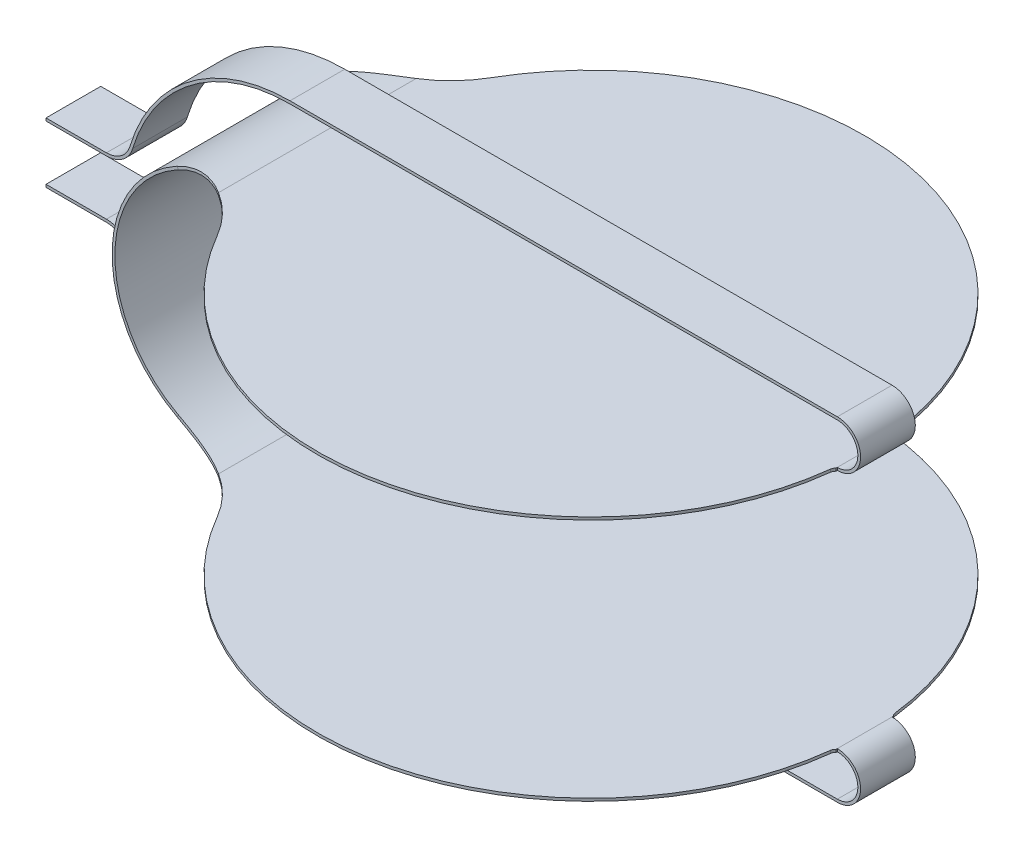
ISO-10303-21;
HEADER;
FILE_DESCRIPTION(('STEP AP214'),'2;1');
FILE_NAME('part.step','',(''),(''),'','','');
FILE_SCHEMA(('AUTOMOTIVE_DESIGN { 1 0 10303 214 1 1 1 1 }'));
ENDSEC;
DATA;
#1=APPLICATION_CONTEXT('core data for automotive mechanical design processes');
#2=APPLICATION_PROTOCOL_DEFINITION('international standard','automotive_design',2000,#1);
#3=PRODUCT_CONTEXT('',#1,'mechanical');
#4=PRODUCT('Part','Part','',(#3));
#5=PRODUCT_RELATED_PRODUCT_CATEGORY('part','',(#4));
#6=PRODUCT_DEFINITION_FORMATION('','',#4);
#7=PRODUCT_DEFINITION_CONTEXT('part definition',#1,'design');
#8=PRODUCT_DEFINITION('design','',#6,#7);
#9=PRODUCT_DEFINITION_SHAPE('','',#8);
#10=(LENGTH_UNIT() NAMED_UNIT(*) SI_UNIT(.MILLI.,.METRE.));
#11=(NAMED_UNIT(*) PLANE_ANGLE_UNIT() SI_UNIT($,.RADIAN.));
#12=(NAMED_UNIT(*) SI_UNIT($,.STERADIAN.) SOLID_ANGLE_UNIT());
#13=UNCERTAINTY_MEASURE_WITH_UNIT(LENGTH_MEASURE(1.E-05),#10,'distance_accuracy_value','');
#14=(GEOMETRIC_REPRESENTATION_CONTEXT(3) GLOBAL_UNCERTAINTY_ASSIGNED_CONTEXT((#13)) GLOBAL_UNIT_ASSIGNED_CONTEXT((#10,
#11,#12)) REPRESENTATION_CONTEXT('',''));
#15=CARTESIAN_POINT('',(0.,0.,0.));
#16=DIRECTION('',(0.,0.,1.));
#17=DIRECTION('',(1.,0.,0.));
#18=AXIS2_PLACEMENT_3D('',#15,#16,#17);
#19=CARTESIAN_POINT('',(0.,22.5,75.));
#20=DIRECTION('',(0.,1.,0.));
#21=DIRECTION('',(0.,0.,1.));
#22=AXIS2_PLACEMENT_3D('',#19,#20,#21);
#23=PLANE('',#22);
#24=CARTESIAN_POINT('',(50.,22.5,0.));
#25=DIRECTION('',(0.,1.,0.));
#26=DIRECTION('',(0.,0.,1.));
#27=AXIS2_PLACEMENT_3D('',#24,#25,#26);
#28=CIRCLE('',#27,50.);
#29=CARTESIAN_POINT('',(99.6527735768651,22.5,5.88235294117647));
#30=VERTEX_POINT('',#29);
#31=CARTESIAN_POINT('',(6.69872981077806,22.5,25.));
#32=VERTEX_POINT('',#31);
#33=EDGE_CURVE('E352',#30,#32,#28,.F.);
#34=ORIENTED_EDGE('',*,*,#33,.F.);
#35=CARTESIAN_POINT('',(100.645829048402,22.5,6.));
#36=DIRECTION('',(0.,1.,0.));
#37=DIRECTION('',(0.,0.,1.));
#38=AXIS2_PLACEMENT_3D('',#35,#36,#37);
#39=CIRCLE('',#38,0.999999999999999);
#40=CARTESIAN_POINT('',(100.,22.5,5.23651795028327));
#41=VERTEX_POINT('',#40);
#42=EDGE_CURVE('E413',#41,#30,#39,.T.);
#43=ORIENTED_EDGE('',*,*,#42,.F.);
#44=DIRECTION('',(0.,0.,-1.));
#45=VECTOR('',#44,1.);
#46=CARTESIAN_POINT('',(100.,22.5,75.));
#47=LINE('',#46,#45);
#48=CARTESIAN_POINT('',(100.,22.5,5.));
#49=VERTEX_POINT('',#48);
#50=EDGE_CURVE('E737',#41,#49,#47,.T.);
#51=ORIENTED_EDGE('',*,*,#50,.T.);
#52=CARTESIAN_POINT('',(100.,22.5,-5.));
#53=VERTEX_POINT('',#52);
#54=EDGE_CURVE('E736',#49,#53,#47,.T.);
#55=ORIENTED_EDGE('',*,*,#54,.T.);
#56=DIRECTION('',(0.,0.,-1.));
#57=VECTOR('',#56,1.);
#58=CARTESIAN_POINT('',(100.,22.5,75.));
#59=LINE('',#58,#57);
#60=CARTESIAN_POINT('',(100.,22.5,-5.23651795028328));
#61=VERTEX_POINT('',#60);
#62=EDGE_CURVE('E676',#53,#61,#59,.T.);
#63=ORIENTED_EDGE('',*,*,#62,.T.);
#64=CARTESIAN_POINT('',(100.645829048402,22.5,-6.));
#65=DIRECTION('',(0.,1.,0.));
#66=DIRECTION('',(0.,0.,1.));
#67=AXIS2_PLACEMENT_3D('',#64,#65,#66);
#68=CIRCLE('',#67,0.999999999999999);
#69=CARTESIAN_POINT('',(99.6527735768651,22.5,-5.88235294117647));
#70=VERTEX_POINT('',#69);
#71=EDGE_CURVE('E513',#70,#61,#68,.T.);
#72=ORIENTED_EDGE('',*,*,#71,.F.);
#73=CARTESIAN_POINT('',(50.,22.5,0.));
#74=DIRECTION('',(0.,1.,0.));
#75=DIRECTION('',(0.,0.,1.));
#76=AXIS2_PLACEMENT_3D('',#73,#74,#75);
#77=CIRCLE('',#76,50.);
#78=CARTESIAN_POINT('',(6.69872981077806,22.5,-25.));
#79=VERTEX_POINT('',#78);
#80=EDGE_CURVE('E515',#79,#70,#77,.F.);
#81=ORIENTED_EDGE('',*,*,#80,.F.);
#82=CARTESIAN_POINT('',(-10.6217782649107,22.5,-35.));
#83=DIRECTION('',(0.,1.,0.));
#84=DIRECTION('',(0.,0.,1.));
#85=AXIS2_PLACEMENT_3D('',#82,#83,#84);
#86=CIRCLE('',#85,20.);
#87=CARTESIAN_POINT('',(0.,22.5,-18.0536780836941));
#88=VERTEX_POINT('',#87);
#89=EDGE_CURVE('E472',#88,#79,#86,.T.);
#90=ORIENTED_EDGE('',*,*,#89,.F.);
#91=DIRECTION('',(0.,0.,-1.));
#92=VECTOR('',#91,1.);
#93=CARTESIAN_POINT('',(0.,22.5,75.));
#94=LINE('',#93,#92);
#95=CARTESIAN_POINT('',(0.,22.5,18.0536780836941));
#96=VERTEX_POINT('',#95);
#97=EDGE_CURVE('E734',#96,#88,#94,.T.);
#98=ORIENTED_EDGE('',*,*,#97,.F.);
#99=CARTESIAN_POINT('',(-10.6217782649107,22.5,35.));
#100=DIRECTION('',(0.,1.,0.));
#101=DIRECTION('',(0.,0.,1.));
#102=AXIS2_PLACEMENT_3D('',#99,#100,#101);
#103=CIRCLE('',#102,20.);
#104=EDGE_CURVE('E354',#32,#96,#103,.T.);
#105=ORIENTED_EDGE('',*,*,#104,.F.);
#106=EDGE_LOOP('',(#34,#43,#51,#55,#63,#72,#81,#90,#98,#105));
#107=FACE_BOUND('',#106,.T.);
#108=ADVANCED_FACE('F35',(#107),#23,.T.);
#109=CARTESIAN_POINT('',(0.,0.,75.));
#110=DIRECTION('',(0.,0.,-1.));
#111=DIRECTION('',(-1.,0.,0.));
#112=AXIS2_PLACEMENT_3D('',#109,#110,#111);
#113=CYLINDRICAL_SURFACE('',#112,22.5);
#114=CARTESIAN_POINT('',(0.,0.,15.));
#115=DIRECTION('',(0.,0.,1.));
#116=DIRECTION('',(1.,0.,0.));
#117=AXIS2_PLACEMENT_3D('',#114,#115,#116);
#118=CIRCLE('',#117,22.5);
#119=CARTESIAN_POINT('',(-10.6217814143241,19.8350134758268,15.));
#120=VERTEX_POINT('',#119);
#121=CARTESIAN_POINT('',(-10.863182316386,19.7038389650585,15.));
#122=VERTEX_POINT('',#121);
#123=EDGE_CURVE('E399',#120,#122,#118,.T.);
#124=ORIENTED_EDGE('',*,*,#123,.F.);
#125=CARTESIAN_POINT('',(-10.6217908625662,19.8350084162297,15.));
#126=CARTESIAN_POINT('',(-10.4732683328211,19.9145438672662,15.0000096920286));
#127=CARTESIAN_POINT('',(-10.3238601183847,19.9924055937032,15.0016697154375));
#128=CARTESIAN_POINT('',(-10.0231860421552,20.1448303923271,15.0084127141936));
#129=CARTESIAN_POINT('',(-9.87191788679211,20.2193887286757,15.0135004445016));
#130=CARTESIAN_POINT('',(-9.41292352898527,20.4392431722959,15.0342130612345));
#131=CARTESIAN_POINT('',(-9.10284328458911,20.5791995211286,15.0552924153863));
#132=CARTESIAN_POINT('',(-8.47777750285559,20.8444866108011,15.1127702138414));
#133=CARTESIAN_POINT('',(-8.1627903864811,20.9698125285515,15.149173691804));
#134=CARTESIAN_POINT('',(-7.52949102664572,21.2054444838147,15.2379037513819));
#135=CARTESIAN_POINT('',(-7.21117924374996,21.3157525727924,15.2902281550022));
#136=CARTESIAN_POINT('',(-6.5728937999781,21.5211395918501,15.4113692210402));
#137=CARTESIAN_POINT('',(-6.25292064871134,21.6162229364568,15.4801810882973));
#138=CARTESIAN_POINT('',(-5.61528675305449,21.7905237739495,15.6339862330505));
#139=CARTESIAN_POINT('',(-5.29762705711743,21.8698571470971,15.7188516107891));
#140=CARTESIAN_POINT('',(-4.82242633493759,21.9777297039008,15.8585945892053));
#141=CARTESIAN_POINT('',(-4.66427358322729,22.0118267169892,15.9072383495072));
#142=CARTESIAN_POINT('',(-4.34852155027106,22.0763749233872,16.0086348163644));
#143=CARTESIAN_POINT('',(-4.19092233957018,22.1068256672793,16.0613880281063));
#144=CARTESIAN_POINT('',(-3.68516827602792,22.1989858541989,16.2377881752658));
#145=CARTESIAN_POINT('',(-3.33850728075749,22.2536409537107,16.3695860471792));
#146=CARTESIAN_POINT('',(-2.65103868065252,22.3459704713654,16.653182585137));
#147=CARTESIAN_POINT('',(-2.31023378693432,22.3836372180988,16.8049902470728));
#148=CARTESIAN_POINT('',(-1.63521976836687,22.4430668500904,17.1286750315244));
#149=CARTESIAN_POINT('',(-1.30104081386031,22.4647684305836,17.3006266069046));
#150=CARTESIAN_POINT('',(-0.807260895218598,22.4861177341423,17.5726468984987));
#151=CARTESIAN_POINT('',(-0.643948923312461,22.4913670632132,17.6656483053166));
#152=CARTESIAN_POINT('',(-0.319960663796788,22.498308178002,17.8562444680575));
#153=CARTESIAN_POINT('',(-0.159284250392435,22.5000001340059,17.9538390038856));
#154=CARTESIAN_POINT('',(0.,22.5,18.0536780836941));
#155=B_SPLINE_CURVE_WITH_KNOTS('',3,(#125,#126,#127,#128,#129,#130,#131,#132,#133,#134,#135,
#136,#137,#138,#139,#140,#141,#142,#143,#144,#145,#146,#147,#148,#149,#150,#151,#152,#153,#154),
.UNSPECIFIED.,.F.,.F.,(4,2,2,2,2,2,2,2,2,2,2,2,2,2,4),(0.,0.505395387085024,1.01149331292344,
2.03332420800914,3.05549101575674,4.07751805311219,5.09924820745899,6.11315709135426,
6.61990126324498,7.1267078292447,8.2502497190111,9.37429845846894,10.5026412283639,
11.0665776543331,11.6304870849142),.UNSPECIFIED.);
#156=EDGE_CURVE('E393',#120,#96,#155,.T.);
#157=ORIENTED_EDGE('',*,*,#156,.T.);
#158=ORIENTED_EDGE('',*,*,#97,.T.);
#159=CARTESIAN_POINT('',(-10.6217782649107,19.8350151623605,-15.));
#160=CARTESIAN_POINT('',(-10.4732522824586,19.9145523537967,-14.9999974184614));
#161=CARTESIAN_POINT('',(-10.3238405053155,19.9924157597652,-15.001651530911));
#162=CARTESIAN_POINT('',(-10.023161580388,20.1448425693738,-15.0083904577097));
#163=CARTESIAN_POINT('',(-9.87189216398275,20.2194012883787,-15.0134799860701));
#164=CARTESIAN_POINT('',(-9.41289777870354,20.4392550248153,-15.0342020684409));
#165=CARTESIAN_POINT('',(-9.10281928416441,20.5792101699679,-15.0552932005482));
#166=CARTESIAN_POINT('',(-8.47775507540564,20.8444956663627,-15.1127776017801));
#167=CARTESIAN_POINT('',(-8.1627677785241,20.9698211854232,-15.1491759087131));
#168=CARTESIAN_POINT('',(-7.52946141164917,21.2054552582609,-15.2379092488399));
#169=CARTESIAN_POINT('',(-7.21114269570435,21.3157653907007,-15.2902426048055));
#170=CARTESIAN_POINT('',(-6.57283726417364,21.5211567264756,-15.4113942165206));
#171=CARTESIAN_POINT('',(-6.25285107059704,21.6162424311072,-15.4802075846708));
#172=CARTESIAN_POINT('',(-5.61521068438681,21.7905440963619,-15.6340095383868));
#173=CARTESIAN_POINT('',(-5.29755735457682,21.869875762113,-15.7188705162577));
#174=CARTESIAN_POINT('',(-4.66394935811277,22.013701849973,-15.9051522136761));
#175=CARTESIAN_POINT('',(-4.34799388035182,22.0782041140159,-16.0065641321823));
#176=CARTESIAN_POINT('',(-3.68788212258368,22.1984907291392,-16.2368693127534));
#177=CARTESIAN_POINT('',(-3.34405287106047,22.2527659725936,-16.3674940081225));
#178=CARTESIAN_POINT('',(-2.66214859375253,22.3446055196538,-16.6484247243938));
#179=CARTESIAN_POINT('',(-2.3240754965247,22.3821643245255,-16.7987372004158));
#180=CARTESIAN_POINT('',(-1.64886196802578,22.4421127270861,-17.1217559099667));
#181=CARTESIAN_POINT('',(-1.31188026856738,22.4641783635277,-17.2948553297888));
#182=CARTESIAN_POINT('',(-0.813979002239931,22.4858858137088,-17.568846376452));
#183=CARTESIAN_POINT('',(-0.649293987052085,22.4912231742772,-17.6625543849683));
#184=CARTESIAN_POINT('',(-0.322600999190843,22.4982802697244,-17.8546406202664));
#185=CARTESIAN_POINT('',(-0.160592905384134,22.5000001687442,-17.9530186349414));
#186=CARTESIAN_POINT('',(0.,22.5,-18.0536780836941));
#187=B_SPLINE_CURVE_WITH_KNOTS('',3,(#159,#160,#161,#162,#163,#164,#165,#166,#167,#168,#169,
#170,#171,#172,#173,#174,#175,#176,#177,#178,#179,#180,#181,#182,#183,#184,#185,#186),
.UNSPECIFIED.,.F.,.F.,(4,2,2,2,2,2,2,2,2,2,2,2,2,4),(0.,0.50540687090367,1.01150866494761,
2.0333362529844,3.0555004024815,4.07755700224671,5.09931085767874,6.11325777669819,
7.12666727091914,8.24105607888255,9.35581118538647,10.493232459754,11.0618004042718,
11.6303425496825),.UNSPECIFIED.);
#188=CARTESIAN_POINT('',(-10.6217782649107,19.8350151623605,-15.));
#189=VERTEX_POINT('',#188);
#190=EDGE_CURVE('E463',#189,#88,#187,.T.);
#191=ORIENTED_EDGE('',*,*,#190,.F.);
#192=CARTESIAN_POINT('',(0.,0.,-15.));
#193=DIRECTION('',(0.,0.,1.));
#194=DIRECTION('',(1.,0.,0.));
#195=AXIS2_PLACEMENT_3D('',#192,#193,#194);
#196=CIRCLE('',#195,22.5);
#197=CARTESIAN_POINT('',(-10.863182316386,-19.7038389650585,-15.));
#198=VERTEX_POINT('',#197);
#199=EDGE_CURVE('E456',#198,#189,#196,.F.);
#200=ORIENTED_EDGE('',*,*,#199,.F.);
#201=CARTESIAN_POINT('',(0.,0.,-15.));
#202=DIRECTION('',(0.,0.,-1.));
#203=DIRECTION('',(-1.,0.,0.));
#204=AXIS2_PLACEMENT_3D('',#201,#202,#203);
#205=CIRCLE('',#204,22.5);
#206=CARTESIAN_POINT('',(-10.6217814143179,-19.8350134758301,-15.));
#207=VERTEX_POINT('',#206);
#208=EDGE_CURVE('E884',#207,#198,#205,.T.);
#209=ORIENTED_EDGE('',*,*,#208,.F.);
#210=CARTESIAN_POINT('',(-10.6217908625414,-19.835008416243,-15.));
#211=CARTESIAN_POINT('',(-10.4732677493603,-19.9145441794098,-15.0000199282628));
#212=CARTESIAN_POINT('',(-10.3238589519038,-19.9924062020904,-15.0016849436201));
#213=CARTESIAN_POINT('',(-10.0231856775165,-20.1448305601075,-15.0084316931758));
#214=CARTESIAN_POINT('',(-9.87191892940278,-20.2193882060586,-15.0135181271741));
#215=CARTESIAN_POINT('',(-9.41292973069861,-20.4392402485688,-15.0342237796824));
#216=CARTESIAN_POINT('',(-9.10285307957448,-20.5791951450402,-15.0552943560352));
#217=CARTESIAN_POINT('',(-8.47779453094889,-20.8444796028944,-15.1127655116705));
#218=CARTESIAN_POINT('',(-8.16281104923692,-20.9698043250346,-15.1491711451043));
#219=CARTESIAN_POINT('',(-7.52951110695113,-21.2054375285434,-15.2379001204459));
#220=CARTESIAN_POINT('',(-7.21119501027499,-21.3157476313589,-15.2902217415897));
#221=CARTESIAN_POINT('',(-6.57289658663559,-21.5211385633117,-15.4113626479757));
#222=CARTESIAN_POINT('',(-6.25291478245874,-21.616223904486,-15.4801770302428));
#223=CARTESIAN_POINT('',(-5.61528737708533,-21.7905242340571,-15.6339859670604));
#224=CARTESIAN_POINT('',(-5.297642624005,-21.8698550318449,-15.7188527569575));
#225=CARTESIAN_POINT('',(-4.66404743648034,-22.0136809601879,-15.9051318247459));
#226=CARTESIAN_POINT('',(-4.34809619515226,-22.0781839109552,-16.0065353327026));
#227=CARTESIAN_POINT('',(-3.68797782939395,-22.1984750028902,-16.2368289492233));
#228=CARTESIAN_POINT('',(-3.3441378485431,-22.2527533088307,-16.3674514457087));
#229=CARTESIAN_POINT('',(-2.66221657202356,-22.3445975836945,-16.648387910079));
#230=CARTESIAN_POINT('',(-2.32413720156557,-22.3821580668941,-16.7987083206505));
#231=CARTESIAN_POINT('',(-1.64890774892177,-22.4421094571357,-17.1217369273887));
#232=CARTESIAN_POINT('',(-1.31191634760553,-22.46417637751,-17.2948382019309));
#233=CARTESIAN_POINT('',(-0.814001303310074,-22.4858850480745,-17.5688343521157));
#234=CARTESIAN_POINT('',(-0.649311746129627,-22.4912226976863,-17.6625444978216));
#235=CARTESIAN_POINT('',(-0.322609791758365,-22.4982801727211,-17.8546354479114));
#236=CARTESIAN_POINT('',(-0.160597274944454,-22.5000001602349,-17.953016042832));
#237=CARTESIAN_POINT('',(0.,-22.5,-18.0536780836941));
#238=B_SPLINE_CURVE_WITH_KNOTS('',3,(#210,#211,#212,#213,#214,#215,#216,#217,#218,#219,#220,
#221,#222,#223,#224,#225,#226,#227,#228,#229,#230,#231,#232,#233,#234,#235,#236,#237),
.UNSPECIFIED.,.F.,.F.,(4,2,2,2,2,2,2,2,2,2,2,2,2,4),(0.,0.505397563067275,1.01149078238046,
2.0333085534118,3.05546336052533,4.07750769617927,5.09924857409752,6.11317555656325,
7.12656656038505,8.24098342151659,9.35576569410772,10.4932158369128,11.0617987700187,
11.6303562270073),.UNSPECIFIED.);
#239=CARTESIAN_POINT('',(0.,-22.5,-18.0536780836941));
#240=VERTEX_POINT('',#239);
#241=EDGE_CURVE('E869',#207,#240,#238,.T.);
#242=ORIENTED_EDGE('',*,*,#241,.T.);
#243=DIRECTION('',(0.,0.,-1.));
#244=VECTOR('',#243,1.);
#245=CARTESIAN_POINT('',(0.,-22.5,75.));
#246=LINE('',#245,#244);
#247=CARTESIAN_POINT('',(0.,-22.5,18.0536780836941));
#248=VERTEX_POINT('',#247);
#249=EDGE_CURVE('E732',#248,#240,#246,.T.);
#250=ORIENTED_EDGE('',*,*,#249,.F.);
#251=CARTESIAN_POINT('',(-10.6217782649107,-19.8350151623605,15.));
#252=CARTESIAN_POINT('',(-10.4732599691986,-19.9145492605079,14.9999950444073));
#253=CARTESIAN_POINT('',(-10.3238459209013,-19.9924134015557,15.0016499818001));
#254=CARTESIAN_POINT('',(-10.0231624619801,-20.1448417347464,15.0083907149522));
#255=CARTESIAN_POINT('',(-9.87189078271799,-20.2194012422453,15.0134812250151));
#256=CARTESIAN_POINT('',(-9.56637679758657,-20.3657408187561,15.0272707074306));
#257=CARTESIAN_POINT('',(-9.41211991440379,-20.4374873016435,15.0360038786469));
#258=CARTESIAN_POINT('',(-9.10223220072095,-20.5773730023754,15.0572144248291));
#259=CARTESIAN_POINT('',(-8.94660130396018,-20.645512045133,15.0696919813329));
#260=CARTESIAN_POINT('',(-8.47780622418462,-20.8444721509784,15.1128283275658));
#261=CARTESIAN_POINT('',(-8.16279531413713,-20.9698095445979,15.1491883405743));
#262=CARTESIAN_POINT('',(-7.52947455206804,-21.2054517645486,15.2378913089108));
#263=CARTESIAN_POINT('',(-7.21116504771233,-21.3157581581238,15.2902325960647));
#264=CARTESIAN_POINT('',(-6.5728693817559,-21.5211464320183,15.4113887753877));
#265=CARTESIAN_POINT('',(-6.25288374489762,-21.6162328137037,15.4801987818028));
#266=CARTESIAN_POINT('',(-5.6152468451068,-21.7905348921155,15.6339975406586));
#267=CARTESIAN_POINT('',(-5.29759642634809,-21.8698662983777,15.7188586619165));
#268=CARTESIAN_POINT('',(-4.66399359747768,-22.0136924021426,15.9051393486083));
#269=CARTESIAN_POINT('',(-4.34804037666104,-22.0781949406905,16.0065501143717));
#270=CARTESIAN_POINT('',(-3.68792550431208,-22.1984835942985,16.2368514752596));
#271=CARTESIAN_POINT('',(-3.34409080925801,-22.2527603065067,16.3674735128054));
#272=CARTESIAN_POINT('',(-2.66217869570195,-22.3446020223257,16.6484066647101));
#273=CARTESIAN_POINT('',(-2.3241032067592,-22.3821615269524,16.7987242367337));
#274=CARTESIAN_POINT('',(-1.6488825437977,-22.4421112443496,17.1217482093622));
#275=CARTESIAN_POINT('',(-1.31189605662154,-22.4641774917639,17.2948476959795));
#276=CARTESIAN_POINT('',(-0.813988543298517,-22.4858854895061,17.5688408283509));
#277=CARTESIAN_POINT('',(-0.649301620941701,-22.4912229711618,17.6625498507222));
#278=CARTESIAN_POINT('',(-0.322604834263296,-22.4982802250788,17.8546383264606));
#279=CARTESIAN_POINT('',(-0.160594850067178,-22.5000001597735,17.9530175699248));
#280=CARTESIAN_POINT('',(0.,-22.5,18.0536780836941));
#281=B_SPLINE_CURVE_WITH_KNOTS('',3,(#251,#252,#253,#254,#255,#256,#257,#258,#259,#260,#261,
#262,#263,#264,#265,#266,#267,#268,#269,#270,#271,#272,#273,#274,#275,#276,#277,#278,#279,#280),
.UNSPECIFIED.,.F.,.F.,(4,2,2,2,2,2,2,2,2,2,2,2,2,2,4),(0.,0.505403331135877,1.01150159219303,
1.52246225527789,2.03344769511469,3.05560352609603,4.07765269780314,5.09939903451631,
6.11333868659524,7.12674095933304,8.24114253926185,9.35591042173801,10.4933448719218,
11.0619192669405,11.630468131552),.UNSPECIFIED.);
#282=CARTESIAN_POINT('',(-10.6217782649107,-19.8350151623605,15.));
#283=VERTEX_POINT('',#282);
#284=EDGE_CURVE('E346',#283,#248,#281,.T.);
#285=ORIENTED_EDGE('',*,*,#284,.F.);
#286=CARTESIAN_POINT('',(0.,0.,15.));
#287=DIRECTION('',(0.,0.,-1.));
#288=DIRECTION('',(-1.,0.,0.));
#289=AXIS2_PLACEMENT_3D('',#286,#287,#288);
#290=CIRCLE('',#289,22.5);
#291=EDGE_CURVE('E359',#122,#283,#290,.F.);
#292=ORIENTED_EDGE('',*,*,#291,.F.);
#293=EDGE_LOOP('',(#124,#157,#158,#191,#200,#209,#242,#250,#285,#292));
#294=FACE_BOUND('',#293,.T.);
#295=ADVANCED_FACE('F842',(#294),#113,.T.);
#296=CARTESIAN_POINT('',(100.,-22.5,75.));
#297=DIRECTION('',(0.,-1.,0.));
#298=DIRECTION('',(1.,0.,0.));
#299=AXIS2_PLACEMENT_3D('',#296,#297,#298);
#300=PLANE('',#299);
#301=DIRECTION('',(0.,0.,-1.));
#302=VECTOR('',#301,1.);
#303=CARTESIAN_POINT('',(100.,-22.5,75.));
#304=LINE('',#303,#302);
#305=CARTESIAN_POINT('',(100.,-22.5,5.23651795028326));
#306=VERTEX_POINT('',#305);
#307=CARTESIAN_POINT('',(100.,-22.5,5.));
#308=VERTEX_POINT('',#307);
#309=EDGE_CURVE('E730',#306,#308,#304,.T.);
#310=ORIENTED_EDGE('',*,*,#309,.F.);
#311=CARTESIAN_POINT('',(100.645829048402,-22.5,6.));
#312=DIRECTION('',(0.,-1.,0.));
#313=DIRECTION('',(1.,0.,0.));
#314=AXIS2_PLACEMENT_3D('',#311,#312,#313);
#315=CIRCLE('',#314,0.999999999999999);
#316=CARTESIAN_POINT('',(99.6527735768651,-22.5,5.88235294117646));
#317=VERTEX_POINT('',#316);
#318=EDGE_CURVE('E50',#317,#306,#315,.T.);
#319=ORIENTED_EDGE('',*,*,#318,.F.);
#320=CARTESIAN_POINT('',(50.,-22.5,0.));
#321=DIRECTION('',(0.,-1.,0.));
#322=DIRECTION('',(1.,0.,0.));
#323=AXIS2_PLACEMENT_3D('',#320,#321,#322);
#324=CIRCLE('',#323,50.);
#325=CARTESIAN_POINT('',(6.69872981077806,-22.5,25.));
#326=VERTEX_POINT('',#325);
#327=EDGE_CURVE('E438',#326,#317,#324,.F.);
#328=ORIENTED_EDGE('',*,*,#327,.F.);
#329=CARTESIAN_POINT('',(-10.6217782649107,-22.5,35.));
#330=DIRECTION('',(0.,-1.,0.));
#331=DIRECTION('',(1.,0.,0.));
#332=AXIS2_PLACEMENT_3D('',#329,#330,#331);
#333=CIRCLE('',#332,20.);
#334=EDGE_CURVE('E435',#248,#326,#333,.T.);
#335=ORIENTED_EDGE('',*,*,#334,.F.);
#336=ORIENTED_EDGE('',*,*,#249,.T.);
#337=CARTESIAN_POINT('',(-10.6217782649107,-22.5,-35.));
#338=DIRECTION('',(0.,-1.,0.));
#339=DIRECTION('',(1.,0.,0.));
#340=AXIS2_PLACEMENT_3D('',#337,#338,#339);
#341=CIRCLE('',#340,20.);
#342=CARTESIAN_POINT('',(6.69872981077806,-22.5,-25.));
#343=VERTEX_POINT('',#342);
#344=EDGE_CURVE('E539',#343,#240,#341,.T.);
#345=ORIENTED_EDGE('',*,*,#344,.F.);
#346=CARTESIAN_POINT('',(50.,-22.5,0.));
#347=DIRECTION('',(0.,-1.,0.));
#348=DIRECTION('',(1.,0.,0.));
#349=AXIS2_PLACEMENT_3D('',#346,#347,#348);
#350=CIRCLE('',#349,50.);
#351=CARTESIAN_POINT('',(99.6527735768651,-22.5,-5.88235294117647));
#352=VERTEX_POINT('',#351);
#353=EDGE_CURVE('E526',#352,#343,#350,.F.);
#354=ORIENTED_EDGE('',*,*,#353,.F.);
#355=CARTESIAN_POINT('',(100.645829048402,-22.5,-6.));
#356=DIRECTION('',(0.,-1.,0.));
#357=DIRECTION('',(1.,0.,0.));
#358=AXIS2_PLACEMENT_3D('',#355,#356,#357);
#359=CIRCLE('',#358,0.999999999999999);
#360=CARTESIAN_POINT('',(100.,-22.5,-5.23651795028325));
#361=VERTEX_POINT('',#360);
#362=EDGE_CURVE('E533',#361,#352,#359,.T.);
#363=ORIENTED_EDGE('',*,*,#362,.F.);
#364=DIRECTION('',(0.,0.,-1.));
#365=VECTOR('',#364,1.);
#366=CARTESIAN_POINT('',(100.,-22.5,75.));
#367=LINE('',#366,#365);
#368=CARTESIAN_POINT('',(100.,-22.5,-5.));
#369=VERTEX_POINT('',#368);
#370=EDGE_CURVE('E557',#361,#369,#367,.F.);
#371=ORIENTED_EDGE('',*,*,#370,.T.);
#372=EDGE_CURVE('E729',#308,#369,#304,.T.);
#373=ORIENTED_EDGE('',*,*,#372,.F.);
#374=EDGE_LOOP('',(#310,#319,#328,#335,#336,#345,#354,#363,#371,#373));
#375=FACE_BOUND('',#374,.T.);
#376=ADVANCED_FACE('F878',(#375),#300,.T.);
#377=CARTESIAN_POINT('',(100.,-22.,75.));
#378=DIRECTION('',(0.,-1.,0.));
#379=DIRECTION('',(1.,0.,0.));
#380=AXIS2_PLACEMENT_3D('',#377,#378,#379);
#381=PLANE('',#380);
#382=CARTESIAN_POINT('',(100.645829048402,-22.,6.));
#383=DIRECTION('',(0.,-1.,0.));
#384=DIRECTION('',(1.,0.,0.));
#385=AXIS2_PLACEMENT_3D('',#382,#383,#384);
#386=CIRCLE('',#385,0.999999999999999);
#387=CARTESIAN_POINT('',(99.6527735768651,-22.,5.88235294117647));
#388=VERTEX_POINT('',#387);
#389=CARTESIAN_POINT('',(100.,-22.,5.23651795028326));
#390=VERTEX_POINT('',#389);
#391=EDGE_CURVE('E444',#388,#390,#386,.T.);
#392=ORIENTED_EDGE('',*,*,#391,.T.);
#393=DIRECTION('',(0.,0.,-1.));
#394=VECTOR('',#393,1.);
#395=CARTESIAN_POINT('',(100.,-22.,75.));
#396=LINE('',#395,#394);
#397=CARTESIAN_POINT('',(100.,-22.,5.));
#398=VERTEX_POINT('',#397);
#399=EDGE_CURVE('E696',#390,#398,#396,.T.);
#400=ORIENTED_EDGE('',*,*,#399,.T.);
#401=CARTESIAN_POINT('',(100.,-22.,-5.));
#402=VERTEX_POINT('',#401);
#403=EDGE_CURVE('E699',#398,#402,#396,.T.);
#404=ORIENTED_EDGE('',*,*,#403,.T.);
#405=CARTESIAN_POINT('',(100.,-22.,-5.23651795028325));
#406=VERTEX_POINT('',#405);
#407=EDGE_CURVE('E695',#402,#406,#396,.T.);
#408=ORIENTED_EDGE('',*,*,#407,.T.);
#409=CARTESIAN_POINT('',(100.645829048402,-22.,-6.));
#410=DIRECTION('',(0.,-1.,0.));
#411=DIRECTION('',(1.,0.,0.));
#412=AXIS2_PLACEMENT_3D('',#409,#410,#411);
#413=CIRCLE('',#412,0.999999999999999);
#414=CARTESIAN_POINT('',(99.6527735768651,-22.,-5.88235294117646));
#415=VERTEX_POINT('',#414);
#416=EDGE_CURVE('E58',#406,#415,#413,.T.);
#417=ORIENTED_EDGE('',*,*,#416,.T.);
#418=CARTESIAN_POINT('',(50.,-22.,0.));
#419=DIRECTION('',(0.,-1.,0.));
#420=DIRECTION('',(1.,0.,0.));
#421=AXIS2_PLACEMENT_3D('',#418,#419,#420);
#422=CIRCLE('',#421,50.);
#423=CARTESIAN_POINT('',(6.69872981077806,-22.,-25.));
#424=VERTEX_POINT('',#423);
#425=EDGE_CURVE('E529',#415,#424,#422,.F.);
#426=ORIENTED_EDGE('',*,*,#425,.T.);
#427=CARTESIAN_POINT('',(-10.6217782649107,-22.,-35.));
#428=DIRECTION('',(0.,-1.,0.));
#429=DIRECTION('',(1.,0.,0.));
#430=AXIS2_PLACEMENT_3D('',#427,#428,#429);
#431=CIRCLE('',#430,20.);
#432=CARTESIAN_POINT('',(0.,-22.,-18.0536780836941));
#433=VERTEX_POINT('',#432);
#434=EDGE_CURVE('E532',#424,#433,#431,.T.);
#435=ORIENTED_EDGE('',*,*,#434,.T.);
#436=DIRECTION('',(0.,0.,-1.));
#437=VECTOR('',#436,1.);
#438=CARTESIAN_POINT('',(0.,-22.,75.));
#439=LINE('',#438,#437);
#440=CARTESIAN_POINT('',(0.,-22.,18.0536780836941));
#441=VERTEX_POINT('',#440);
#442=EDGE_CURVE('E693',#441,#433,#439,.T.);
#443=ORIENTED_EDGE('',*,*,#442,.F.);
#444=CARTESIAN_POINT('',(-10.6217782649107,-22.,35.));
#445=DIRECTION('',(0.,-1.,0.));
#446=DIRECTION('',(1.,0.,0.));
#447=AXIS2_PLACEMENT_3D('',#444,#445,#446);
#448=CIRCLE('',#447,20.);
#449=CARTESIAN_POINT('',(6.69872981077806,-22.,25.));
#450=VERTEX_POINT('',#449);
#451=EDGE_CURVE('E432',#441,#450,#448,.T.);
#452=ORIENTED_EDGE('',*,*,#451,.T.);
#453=CARTESIAN_POINT('',(50.,-22.,0.));
#454=DIRECTION('',(0.,-1.,0.));
#455=DIRECTION('',(1.,0.,0.));
#456=AXIS2_PLACEMENT_3D('',#453,#454,#455);
#457=CIRCLE('',#456,50.);
#458=EDGE_CURVE('E437',#450,#388,#457,.F.);
#459=ORIENTED_EDGE('',*,*,#458,.T.);
#460=EDGE_LOOP('',(#392,#400,#404,#408,#417,#426,#435,#443,#452,#459));
#461=FACE_BOUND('',#460,.T.);
#462=ADVANCED_FACE('F857',(#461),#381,.F.);
#463=CARTESIAN_POINT('',(0.,0.,75.));
#464=DIRECTION('',(0.,0.,-1.));
#465=DIRECTION('',(-1.,0.,0.));
#466=AXIS2_PLACEMENT_3D('',#463,#464,#465);
#467=CYLINDRICAL_SURFACE('',#466,22.);
#468=CARTESIAN_POINT('',(-10.3857502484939,19.3942308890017,15.));
#469=CARTESIAN_POINT('',(-10.2386643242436,19.4729970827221,15.0000101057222));
#470=CARTESIAN_POINT('',(-10.0906901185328,19.5500842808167,15.0017128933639));
#471=CARTESIAN_POINT('',(-9.79294568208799,19.7009160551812,15.0086296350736));
#472=CARTESIAN_POINT('',(-9.6431738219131,19.7746572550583,15.0138470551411));
#473=CARTESIAN_POINT('',(-9.18869254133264,19.9920332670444,15.0350900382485));
#474=CARTESIAN_POINT('',(-8.88163784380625,20.1303096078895,15.0567115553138));
#475=CARTESIAN_POINT('',(-8.26271970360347,20.3921656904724,15.1156655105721));
#476=CARTESIAN_POINT('',(-7.95085496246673,20.5157413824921,15.1530022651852));
#477=CARTESIAN_POINT('',(-7.32354560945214,20.7479555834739,15.2440501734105));
#478=CARTESIAN_POINT('',(-7.00809730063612,20.8565767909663,15.2977800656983));
#479=CARTESIAN_POINT('',(-6.37562244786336,21.0585284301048,15.422192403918));
#480=CARTESIAN_POINT('',(-6.05859589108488,21.1518587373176,15.4928749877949));
#481=CARTESIAN_POINT('',(-5.54251091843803,21.291387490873,15.6219284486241));
#482=CARTESIAN_POINT('',(-5.34338186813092,21.3422145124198,15.6751177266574));
#483=CARTESIAN_POINT('',(-4.94561066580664,21.4378817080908,15.7883269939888));
#484=CARTESIAN_POINT('',(-4.74696853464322,21.4827216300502,15.8483472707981));
#485=CARTESIAN_POINT('',(-4.35053637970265,21.5664990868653,15.9751466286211));
#486=CARTESIAN_POINT('',(-4.1527466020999,21.6054350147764,16.0419275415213));
#487=CARTESIAN_POINT('',(-3.75853533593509,21.6774902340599,16.182270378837));
#488=CARTESIAN_POINT('',(-3.56211382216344,21.7106096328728,16.2558321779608));
#489=CARTESIAN_POINT('',(-2.97574105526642,21.8014043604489,16.486465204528));
#490=CARTESIAN_POINT('',(-2.58835382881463,21.8505847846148,16.6535886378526));
#491=CARTESIAN_POINT('',(-1.82383771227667,21.9276354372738,17.0136113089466));
#492=CARTESIAN_POINT('',(-1.44670390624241,21.9555160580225,17.2064979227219));
#493=CARTESIAN_POINT('',(-0.893228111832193,21.9826223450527,17.5129341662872));
#494=CARTESIAN_POINT('',(-0.711994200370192,21.9892093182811,17.6171470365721));
#495=CARTESIAN_POINT('',(-0.353247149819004,21.9978940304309,17.8311991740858));
#496=CARTESIAN_POINT('',(-0.175727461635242,22.0000004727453,17.9410271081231));
#497=CARTESIAN_POINT('',(0.,22.,18.0536780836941));
#498=B_SPLINE_CURVE_WITH_KNOTS('',3,(#468,#469,#470,#471,#472,#473,#474,#475,#476,#477,#478,
#479,#480,#481,#482,#483,#484,#485,#486,#487,#488,#489,#490,#491,#492,#493,#494,#495,#496,#497),
.UNSPECIFIED.,.F.,.F.,(4,2,2,2,2,2,2,2,2,2,2,2,2,2,4),(0.,0.500505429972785,1.0015051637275,
2.01308641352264,3.02494569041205,4.0379659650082,5.05099448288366,5.68767445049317,
6.32438122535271,6.96126098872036,7.59812898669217,8.87081602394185,10.1428817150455,
10.7702366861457,11.3963719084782),.UNSPECIFIED.);
#499=CARTESIAN_POINT('',(-10.3857416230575,19.3942355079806,15.));
#500=VERTEX_POINT('',#499);
#501=CARTESIAN_POINT('',(0.,22.,18.0536780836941));
#502=VERTEX_POINT('',#501);
#503=EDGE_CURVE('E351',#500,#502,#498,.T.);
#504=ORIENTED_EDGE('',*,*,#503,.F.);
#505=CARTESIAN_POINT('',(0.,0.,15.));
#506=DIRECTION('',(0.,0.,1.));
#507=DIRECTION('',(1.,0.,0.));
#508=AXIS2_PLACEMENT_3D('',#505,#506,#507);
#509=CIRCLE('',#508,22.);
#510=CARTESIAN_POINT('',(-10.6217782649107,19.2659758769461,15.));
#511=VERTEX_POINT('',#510);
#512=EDGE_CURVE('E339',#500,#511,#509,.T.);
#513=ORIENTED_EDGE('',*,*,#512,.T.);
#514=CARTESIAN_POINT('',(0.,0.,15.));
#515=DIRECTION('',(0.,0.,-1.));
#516=DIRECTION('',(-1.,0.,0.));
#517=AXIS2_PLACEMENT_3D('',#514,#515,#516);
#518=CIRCLE('',#517,22.);
#519=CARTESIAN_POINT('',(-10.6217782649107,-19.2659758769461,15.));
#520=VERTEX_POINT('',#519);
#521=EDGE_CURVE('E335',#511,#520,#518,.F.);
#522=ORIENTED_EDGE('',*,*,#521,.T.);
#523=CARTESIAN_POINT('',(0.,0.,15.));
#524=DIRECTION('',(0.,0.,1.));
#525=DIRECTION('',(1.,0.,0.));
#526=AXIS2_PLACEMENT_3D('',#523,#524,#525);
#527=CIRCLE('',#526,22.);
#528=CARTESIAN_POINT('',(-10.3857419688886,-19.3942353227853,15.));
#529=VERTEX_POINT('',#528);
#530=EDGE_CURVE('E343',#520,#529,#527,.T.);
#531=ORIENTED_EDGE('',*,*,#530,.T.);
#532=CARTESIAN_POINT('',(0.,-22.,18.0536780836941));
#533=CARTESIAN_POINT('',(-0.140464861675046,-22.0000000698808,17.9636343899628));
#534=CARTESIAN_POINT('',(-0.282073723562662,-21.9986545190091,17.8753918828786));
#535=CARTESIAN_POINT('',(-0.567610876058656,-21.9931405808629,17.7025117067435));
#536=CARTESIAN_POINT('',(-0.71154131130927,-21.9889694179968,17.617877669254));
#537=CARTESIAN_POINT('',(-1.14917376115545,-21.9719171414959,17.3680945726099));
#538=CARTESIAN_POINT('',(-1.44606537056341,-21.9544917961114,17.2087659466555));
#539=CARTESIAN_POINT('',(-2.0469839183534,-21.9066368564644,16.9061566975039));
#540=CARTESIAN_POINT('',(-2.3510127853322,-21.876203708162,16.7628804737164));
#541=CARTESIAN_POINT('',(-2.9650352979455,-21.8014751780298,16.4927512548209));
#542=CARTESIAN_POINT('',(-3.27503524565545,-21.7571643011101,16.3659168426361));
#543=CARTESIAN_POINT('',(-3.89912441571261,-21.6540258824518,16.1292450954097));
#544=CARTESIAN_POINT('',(-4.21321380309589,-21.5951977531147,16.0194084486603));
#545=CARTESIAN_POINT('',(-4.72582091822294,-21.4873757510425,15.8548295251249));
#546=CARTESIAN_POINT('',(-4.92363575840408,-21.4429305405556,15.7948439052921));
#547=CARTESIAN_POINT('',(-5.31973245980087,-21.3481130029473,15.6816121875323));
#548=CARTESIAN_POINT('',(-5.51801424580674,-21.2977415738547,15.6283650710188));
#549=CARTESIAN_POINT('',(-6.11310722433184,-21.1376098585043,15.4786924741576));
#550=CARTESIAN_POINT('',(-6.510117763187,-21.0188422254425,15.3923511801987));
#551=CARTESIAN_POINT('',(-7.30076457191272,-20.7574612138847,15.2461335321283));
#552=CARTESIAN_POINT('',(-7.69440286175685,-20.6148633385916,15.1862400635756));
#553=CARTESIAN_POINT('',(-8.47531206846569,-20.3062842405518,15.0916370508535));
#554=CARTESIAN_POINT('',(-8.86258595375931,-20.1403142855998,15.0569154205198));
#555=CARTESIAN_POINT('',(-9.43803358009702,-19.8738202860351,15.0225170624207));
#556=CARTESIAN_POINT('',(-9.62965121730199,-19.7816846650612,15.0140000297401));
#557=CARTESIAN_POINT('',(-10.0099055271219,-19.5920097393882,15.00274566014));
#558=CARTESIAN_POINT('',(-10.1985472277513,-19.4944811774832,14.9999972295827));
#559=CARTESIAN_POINT('',(-10.3857516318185,-19.3942301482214,15.));
#560=B_SPLINE_CURVE_WITH_KNOTS('',3,(#532,#533,#534,#535,#536,#537,#538,#539,#540,#541,#542,
#543,#544,#545,#546,#547,#548,#549,#550,#551,#552,#553,#554,#555,#556,#557,#558,#559),
.UNSPECIFIED.,.F.,.F.,(4,2,2,2,2,2,2,2,2,2,2,2,2,4),(0.,0.500505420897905,1.00150320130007,
2.01293357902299,3.02464048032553,4.03748104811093,5.05036261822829,5.68448486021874,
6.31851113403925,7.58671819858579,8.85410339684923,10.1208796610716,10.7591008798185,
11.3960936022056),.UNSPECIFIED.);
#561=EDGE_CURVE('E356',#441,#529,#560,.T.);
#562=ORIENTED_EDGE('',*,*,#561,.F.);
#563=ORIENTED_EDGE('',*,*,#442,.T.);
#564=CARTESIAN_POINT('',(-10.3857502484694,-19.3942308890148,-15.));
#565=CARTESIAN_POINT('',(-10.2386647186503,-19.472996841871,-15.0000208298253));
#566=CARTESIAN_POINT('',(-10.0906910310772,-19.5500837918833,-15.0017285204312));
#567=CARTESIAN_POINT('',(-9.79294748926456,-19.7009151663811,-15.0086485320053));
#568=CARTESIAN_POINT('',(-9.64317600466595,-19.7746562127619,-15.0138643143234));
#569=CARTESIAN_POINT('',(-9.18869410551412,-19.992032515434,-15.0351002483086));
#570=CARTESIAN_POINT('',(-8.8816378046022,-20.1303094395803,-15.0567142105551));
#571=CARTESIAN_POINT('',(-8.26271973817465,-20.3921658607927,-15.115662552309));
#572=CARTESIAN_POINT('',(-7.95085667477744,-20.5157413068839,-15.1530012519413));
#573=CARTESIAN_POINT('',(-7.32354108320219,-20.7479567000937,-15.2440509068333));
#574=CARTESIAN_POINT('',(-7.00808485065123,-20.8565793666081,-15.2977805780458));
#575=CARTESIAN_POINT('',(-6.37562947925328,-21.0585275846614,-15.4221832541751));
#576=CARTESIAN_POINT('',(-6.05863032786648,-21.1518530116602,-15.492856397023));
#577=CARTESIAN_POINT('',(-5.34336160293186,-21.3452250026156,-15.6717352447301));
#578=CARTESIAN_POINT('',(-4.94512229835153,-21.4408453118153,-15.7849186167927));
#579=CARTESIAN_POINT('',(-4.15224797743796,-21.6084038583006,-16.0385191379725));
#580=CARTESIAN_POINT('',(-3.75761402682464,-21.6803353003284,-16.1789440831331));
#581=CARTESIAN_POINT('',(-2.97563211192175,-21.8014240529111,-16.486501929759));
#582=CARTESIAN_POINT('',(-2.58827986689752,-21.8505951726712,-16.653618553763));
#583=CARTESIAN_POINT('',(-1.82378002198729,-21.9276383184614,-17.013642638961));
#584=CARTESIAN_POINT('',(-1.44662753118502,-21.9555207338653,-17.2065374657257));
#585=CARTESIAN_POINT('',(-0.893155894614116,-21.9826254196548,-17.5129739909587));
#586=CARTESIAN_POINT('',(-0.711937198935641,-21.9892111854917,-17.6171794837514));
#587=CARTESIAN_POINT('',(-0.353220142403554,-21.9978941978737,-17.8312158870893));
#588=CARTESIAN_POINT('',(-0.175715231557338,-22.0000001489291,-17.9410354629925));
#589=CARTESIAN_POINT('',(0.,-22.,-18.0536780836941));
#590=B_SPLINE_CURVE_WITH_KNOTS('',3,(#564,#565,#566,#567,#568,#569,#570,#571,#572,#573,#574,
#575,#576,#577,#578,#579,#580,#581,#582,#583,#584,#585,#586,#587,#588,#589),.UNSPECIFIED.,.F.,
.F.,(4,2,2,2,2,2,2,2,2,2,2,2,4),(0.,0.500504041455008,1.00150264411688,2.01308553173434,
3.02494651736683,4.03796724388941,5.05099621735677,6.3241164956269,7.59760165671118,
8.87031314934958,10.1424031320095,10.7697096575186,11.395796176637),.UNSPECIFIED.);
#591=CARTESIAN_POINT('',(-10.3857416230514,-19.3942355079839,-15.));
#592=VERTEX_POINT('',#591);
#593=EDGE_CURVE('E861',#592,#433,#590,.T.);
#594=ORIENTED_EDGE('',*,*,#593,.F.);
#595=CARTESIAN_POINT('',(0.,0.,-15.));
#596=DIRECTION('',(0.,0.,-1.));
#597=DIRECTION('',(-1.,0.,0.));
#598=AXIS2_PLACEMENT_3D('',#595,#596,#597);
#599=CIRCLE('',#598,22.);
#600=CARTESIAN_POINT('',(-10.6217782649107,-19.2659758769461,-15.));
#601=VERTEX_POINT('',#600);
#602=EDGE_CURVE('E868',#592,#601,#599,.T.);
#603=ORIENTED_EDGE('',*,*,#602,.T.);
#604=CARTESIAN_POINT('',(0.,0.,-15.));
#605=DIRECTION('',(0.,0.,-1.));
#606=DIRECTION('',(-1.,0.,0.));
#607=AXIS2_PLACEMENT_3D('',#604,#605,#606);
#608=CIRCLE('',#607,22.);
#609=CARTESIAN_POINT('',(-10.6217782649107,19.2659758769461,-15.));
#610=VERTEX_POINT('',#609);
#611=EDGE_CURVE('E459',#601,#610,#608,.T.);
#612=ORIENTED_EDGE('',*,*,#611,.T.);
#613=CARTESIAN_POINT('',(0.,0.,-15.));
#614=DIRECTION('',(0.,0.,-1.));
#615=DIRECTION('',(-1.,0.,0.));
#616=AXIS2_PLACEMENT_3D('',#613,#614,#615);
#617=CIRCLE('',#616,22.);
#618=CARTESIAN_POINT('',(-10.3857419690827,19.3942353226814,-15.));
#619=VERTEX_POINT('',#618);
#620=EDGE_CURVE('E473',#610,#619,#617,.T.);
#621=ORIENTED_EDGE('',*,*,#620,.T.);
#622=CARTESIAN_POINT('',(0.,22.,-18.0536780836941));
#623=CARTESIAN_POINT('',(-0.14046580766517,22.0000000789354,-17.9636336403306));
#624=CARTESIAN_POINT('',(-0.282075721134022,21.9986545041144,-17.8753906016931));
#625=CARTESIAN_POINT('',(-0.567614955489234,21.9931404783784,-17.7025093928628));
#626=CARTESIAN_POINT('',(-0.711546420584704,21.9889692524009,-17.6178748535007));
#627=CARTESIAN_POINT('',(-1.14918165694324,21.9719167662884,-17.3680896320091));
#628=CARTESIAN_POINT('',(-1.44607471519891,21.9544912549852,-17.208758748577));
#629=CARTESIAN_POINT('',(-2.04699843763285,21.9066354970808,-16.906149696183));
#630=CARTESIAN_POINT('',(-2.35103103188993,21.8762016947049,-16.7628759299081));
#631=CARTESIAN_POINT('',(-2.96505741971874,21.8014722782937,-16.4927437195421));
#632=CARTESIAN_POINT('',(-3.27505751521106,21.7571611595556,-16.3659038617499));
#633=CARTESIAN_POINT('',(-3.89915226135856,21.6540207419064,-16.1292303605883));
#634=CARTESIAN_POINT('',(-4.21324707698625,21.5951908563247,-16.0193974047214));
#635=CARTESIAN_POINT('',(-4.72589564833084,21.4873599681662,-15.8548064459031));
#636=CARTESIAN_POINT('',(-4.92374958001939,21.4429055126,-15.7948083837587));
#637=CARTESIAN_POINT('',(-5.31993846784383,21.3480614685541,-15.6815562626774));
#638=CARTESIAN_POINT('',(-5.51827334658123,21.2976727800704,-15.628301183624));
#639=CARTESIAN_POINT('',(-5.91509054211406,21.1908926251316,-15.5284982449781));
#640=CARTESIAN_POINT('',(-6.11357288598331,21.1344991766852,-15.4819526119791));
#641=CARTESIAN_POINT('',(-6.51019203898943,21.0157150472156,-15.3955474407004));
#642=CARTESIAN_POINT('',(-6.70832883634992,20.9533241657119,-15.3556881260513));
#643=CARTESIAN_POINT('',(-7.30131082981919,20.7572629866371,-15.2460528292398));
#644=CARTESIAN_POINT('',(-7.69508245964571,20.6146090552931,-15.1861309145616));
#645=CARTESIAN_POINT('',(-8.47618675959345,20.3059243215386,-15.0915280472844));
#646=CARTESIAN_POINT('',(-8.86352243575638,20.139904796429,-15.0568349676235));
#647=CARTESIAN_POINT('',(-9.43886571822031,19.873422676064,-15.0224799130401));
#648=CARTESIAN_POINT('',(-9.63031415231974,19.7813597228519,-15.0139771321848));
#649=CARTESIAN_POINT('',(-10.0102347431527,19.591839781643,-15.0027405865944));
#650=CARTESIAN_POINT('',(-10.1987119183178,19.4943935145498,-14.9999957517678));
#651=CARTESIAN_POINT('',(-10.3857516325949,19.3942301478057,-15.));
#652=B_SPLINE_CURVE_WITH_KNOTS('',3,(#622,#623,#624,#625,#626,#627,#628,#629,#630,#631,#632,
#633,#634,#635,#636,#637,#638,#639,#640,#641,#642,#643,#644,#645,#646,#647,#648,#649,#650,#651),
.UNSPECIFIED.,.F.,.F.,(4,2,2,2,2,2,2,2,2,2,2,2,2,2,4),(0.,0.500508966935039,1.00151019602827,
2.01294746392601,3.02466138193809,4.03750971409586,5.05039897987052,5.68465561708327,
6.31881618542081,6.95318672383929,7.58757847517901,8.85523201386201,10.1222758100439,
10.7599414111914,11.3963799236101),.UNSPECIFIED.);
#653=CARTESIAN_POINT('',(0.,22.,-18.0536780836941));
#654=VERTEX_POINT('',#653);
#655=EDGE_CURVE('E465',#654,#619,#652,.T.);
#656=ORIENTED_EDGE('',*,*,#655,.F.);
#657=DIRECTION('',(0.,0.,-1.));
#658=VECTOR('',#657,1.);
#659=CARTESIAN_POINT('',(0.,22.,75.));
#660=LINE('',#659,#658);
#661=EDGE_CURVE('E690',#502,#654,#660,.T.);
#662=ORIENTED_EDGE('',*,*,#661,.F.);
#663=EDGE_LOOP('',(#504,#513,#522,#531,#562,#563,#594,#603,#612,#621,#656,#662));
#664=FACE_BOUND('',#663,.T.);
#665=ADVANCED_FACE('F349',(#664),#467,.F.);
#666=CARTESIAN_POINT('',(0.,22.,75.));
#667=DIRECTION('',(0.,1.,0.));
#668=DIRECTION('',(0.,0.,1.));
#669=AXIS2_PLACEMENT_3D('',#666,#667,#668);
#670=PLANE('',#669);
#671=CARTESIAN_POINT('',(100.645829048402,22.,6.));
#672=DIRECTION('',(0.,1.,0.));
#673=DIRECTION('',(0.,0.,1.));
#674=AXIS2_PLACEMENT_3D('',#671,#672,#673);
#675=CIRCLE('',#674,0.999999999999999);
#676=CARTESIAN_POINT('',(100.,22.,5.23651795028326));
#677=VERTEX_POINT('',#676);
#678=CARTESIAN_POINT('',(99.6527735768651,22.,5.88235294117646));
#679=VERTEX_POINT('',#678);
#680=EDGE_CURVE('E414',#677,#679,#675,.T.);
#681=ORIENTED_EDGE('',*,*,#680,.T.);
#682=CARTESIAN_POINT('',(50.,22.,0.));
#683=DIRECTION('',(0.,1.,0.));
#684=DIRECTION('',(0.,0.,1.));
#685=AXIS2_PLACEMENT_3D('',#682,#683,#684);
#686=CIRCLE('',#685,50.);
#687=CARTESIAN_POINT('',(6.69872981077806,22.,25.));
#688=VERTEX_POINT('',#687);
#689=EDGE_CURVE('E409',#679,#688,#686,.F.);
#690=ORIENTED_EDGE('',*,*,#689,.T.);
#691=CARTESIAN_POINT('',(-10.6217782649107,22.,35.));
#692=DIRECTION('',(0.,1.,0.));
#693=DIRECTION('',(0.,0.,1.));
#694=AXIS2_PLACEMENT_3D('',#691,#692,#693);
#695=CIRCLE('',#694,20.);
#696=EDGE_CURVE('E412',#688,#502,#695,.T.);
#697=ORIENTED_EDGE('',*,*,#696,.T.);
#698=ORIENTED_EDGE('',*,*,#661,.T.);
#699=CARTESIAN_POINT('',(-10.6217782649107,22.,-35.));
#700=DIRECTION('',(0.,1.,0.));
#701=DIRECTION('',(0.,0.,1.));
#702=AXIS2_PLACEMENT_3D('',#699,#700,#701);
#703=CIRCLE('',#702,20.);
#704=CARTESIAN_POINT('',(6.69872981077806,22.,-25.));
#705=VERTEX_POINT('',#704);
#706=EDGE_CURVE('E510',#654,#705,#703,.T.);
#707=ORIENTED_EDGE('',*,*,#706,.T.);
#708=CARTESIAN_POINT('',(50.,22.,0.));
#709=DIRECTION('',(0.,1.,0.));
#710=DIRECTION('',(0.,0.,1.));
#711=AXIS2_PLACEMENT_3D('',#708,#709,#710);
#712=CIRCLE('',#711,50.);
#713=CARTESIAN_POINT('',(99.6527735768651,22.,-5.88235294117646));
#714=VERTEX_POINT('',#713);
#715=EDGE_CURVE('E507',#705,#714,#712,.F.);
#716=ORIENTED_EDGE('',*,*,#715,.T.);
#717=CARTESIAN_POINT('',(100.645829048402,22.,-6.));
#718=DIRECTION('',(0.,1.,0.));
#719=DIRECTION('',(0.,0.,1.));
#720=AXIS2_PLACEMENT_3D('',#717,#718,#719);
#721=CIRCLE('',#720,0.999999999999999);
#722=CARTESIAN_POINT('',(100.,22.,-5.23651795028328));
#723=VERTEX_POINT('',#722);
#724=EDGE_CURVE('E503',#714,#723,#721,.T.);
#725=ORIENTED_EDGE('',*,*,#724,.T.);
#726=DIRECTION('',(0.,0.,-1.));
#727=VECTOR('',#726,1.);
#728=CARTESIAN_POINT('',(100.,22.,75.));
#729=LINE('',#728,#727);
#730=CARTESIAN_POINT('',(100.,22.,-5.));
#731=VERTEX_POINT('',#730);
#732=EDGE_CURVE('E687',#731,#723,#729,.T.);
#733=ORIENTED_EDGE('',*,*,#732,.F.);
#734=CARTESIAN_POINT('',(100.,22.,5.));
#735=VERTEX_POINT('',#734);
#736=EDGE_CURVE('E691',#735,#731,#729,.T.);
#737=ORIENTED_EDGE('',*,*,#736,.F.);
#738=EDGE_CURVE('E688',#677,#735,#729,.T.);
#739=ORIENTED_EDGE('',*,*,#738,.F.);
#740=EDGE_LOOP('',(#681,#690,#697,#698,#707,#716,#725,#733,#737,#739));
#741=FACE_BOUND('',#740,.T.);
#742=ADVANCED_FACE('F780',(#741),#670,.F.);
#743=CARTESIAN_POINT('',(100.,25.,5.));
#744=DIRECTION('',(1.,0.,0.));
#745=DIRECTION('',(0.,0.,1.));
#746=AXIS2_PLACEMENT_3D('',#743,#744,#745);
#747=PLANE('',#746);
#748=ORIENTED_EDGE('',*,*,#50,.F.);
#749=DIRECTION('',(0.,1.,0.));
#750=VECTOR('',#749,1.);
#751=CARTESIAN_POINT('',(100.,22.5,5.23651795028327));
#752=LINE('',#751,#750);
#753=EDGE_CURVE('E426',#41,#677,#752,.F.);
#754=ORIENTED_EDGE('',*,*,#753,.T.);
#755=ORIENTED_EDGE('',*,*,#738,.T.);
#756=DIRECTION('',(0.,1.,0.));
#757=VECTOR('',#756,1.);
#758=CARTESIAN_POINT('',(100.,20.,5.));
#759=LINE('',#758,#757);
#760=EDGE_CURVE('E617',#735,#49,#759,.T.);
#761=ORIENTED_EDGE('',*,*,#760,.T.);
#762=EDGE_LOOP('',(#748,#754,#755,#761));
#763=FACE_BOUND('',#762,.T.);
#764=ADVANCED_FACE('F830',(#763),#747,.T.);
#765=CARTESIAN_POINT('',(100.,-20.,5.));
#766=DIRECTION('',(1.,0.,0.));
#767=DIRECTION('',(0.,0.,1.));
#768=AXIS2_PLACEMENT_3D('',#765,#766,#767);
#769=PLANE('',#768);
#770=ORIENTED_EDGE('',*,*,#399,.F.);
#771=DIRECTION('',(0.,1.,0.));
#772=VECTOR('',#771,1.);
#773=CARTESIAN_POINT('',(100.,-22.,5.23651795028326));
#774=LINE('',#773,#772);
#775=EDGE_CURVE('E454',#390,#306,#774,.F.);
#776=ORIENTED_EDGE('',*,*,#775,.T.);
#777=ORIENTED_EDGE('',*,*,#309,.T.);
#778=DIRECTION('',(0.,1.,0.));
#779=VECTOR('',#778,1.);
#780=CARTESIAN_POINT('',(100.,-25.,5.));
#781=LINE('',#780,#779);
#782=EDGE_CURVE('E587',#308,#398,#781,.T.);
#783=ORIENTED_EDGE('',*,*,#782,.T.);
#784=EDGE_LOOP('',(#770,#776,#777,#783));
#785=FACE_BOUND('',#784,.T.);
#786=ADVANCED_FACE('F931',(#785),#769,.T.);
#787=CARTESIAN_POINT('',(100.,20.0000000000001,-90.));
#788=DIRECTION('',(1.,0.,0.));
#789=DIRECTION('',(0.,0.,1.));
#790=AXIS2_PLACEMENT_3D('',#787,#788,#789);
#791=PLANE('',#790);
#792=ORIENTED_EDGE('',*,*,#732,.T.);
#793=DIRECTION('',(0.,1.,0.));
#794=VECTOR('',#793,1.);
#795=CARTESIAN_POINT('',(100.,22.5,-5.23651795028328));
#796=LINE('',#795,#794);
#797=EDGE_CURVE('E518',#61,#723,#796,.F.);
#798=ORIENTED_EDGE('',*,*,#797,.F.);
#799=ORIENTED_EDGE('',*,*,#62,.F.);
#800=DIRECTION('',(0.,-1.,0.));
#801=VECTOR('',#800,1.);
#802=CARTESIAN_POINT('',(100.,20.,-5.));
#803=LINE('',#802,#801);
#804=EDGE_CURVE('E646',#53,#731,#803,.T.);
#805=ORIENTED_EDGE('',*,*,#804,.T.);
#806=EDGE_LOOP('',(#792,#798,#799,#805));
#807=FACE_BOUND('',#806,.T.);
#808=ADVANCED_FACE('F778',(#807),#791,.T.);
#809=CARTESIAN_POINT('',(100.,-25.,-90.));
#810=DIRECTION('',(1.,0.,0.));
#811=DIRECTION('',(0.,0.,1.));
#812=AXIS2_PLACEMENT_3D('',#809,#810,#811);
#813=PLANE('',#812);
#814=ORIENTED_EDGE('',*,*,#370,.F.);
#815=DIRECTION('',(0.,-1.,0.));
#816=VECTOR('',#815,1.);
#817=CARTESIAN_POINT('',(100.,-22.5,-5.23651795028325));
#818=LINE('',#817,#816);
#819=EDGE_CURVE('E545',#361,#406,#818,.F.);
#820=ORIENTED_EDGE('',*,*,#819,.T.);
#821=ORIENTED_EDGE('',*,*,#407,.F.);
#822=DIRECTION('',(0.,-1.,0.));
#823=VECTOR('',#822,1.);
#824=CARTESIAN_POINT('',(100.,-25.,-5.));
#825=LINE('',#824,#823);
#826=EDGE_CURVE('E554',#402,#369,#825,.T.);
#827=ORIENTED_EDGE('',*,*,#826,.T.);
#828=EDGE_LOOP('',(#814,#820,#821,#827));
#829=FACE_BOUND('',#828,.T.);
#830=ADVANCED_FACE('F923',(#829),#813,.T.);
#831=CARTESIAN_POINT('',(-44.5803989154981,5.5,75.));
#832=DIRECTION('',(0.,-1.,0.));
#833=DIRECTION('',(1.,0.,0.));
#834=AXIS2_PLACEMENT_3D('',#831,#832,#833);
#835=PLANE('',#834);
#836=DIRECTION('',(0.,0.,-1.));
#837=VECTOR('',#836,1.);
#838=CARTESIAN_POINT('',(-44.5803989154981,5.5,75.));
#839=LINE('',#838,#837);
#840=CARTESIAN_POINT('',(-44.5803989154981,5.5,5.));
#841=VERTEX_POINT('',#840);
#842=CARTESIAN_POINT('',(-44.5803989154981,5.5,-5.));
#843=VERTEX_POINT('',#842);
#844=EDGE_CURVE('E749',#841,#843,#839,.T.);
#845=ORIENTED_EDGE('',*,*,#844,.F.);
#846=DIRECTION('',(1.,0.,0.));
#847=VECTOR('',#846,1.);
#848=CARTESIAN_POINT('',(-44.5803989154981,5.5,5.));
#849=LINE('',#848,#847);
#850=CARTESIAN_POINT('',(-33.5410196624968,5.5,5.00000000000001));
#851=VERTEX_POINT('',#850);
#852=EDGE_CURVE('E629',#841,#851,#849,.T.);
#853=ORIENTED_EDGE('',*,*,#852,.T.);
#854=DIRECTION('',(0.,0.,-1.));
#855=VECTOR('',#854,1.);
#856=CARTESIAN_POINT('',(-33.5410196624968,5.5,75.));
#857=LINE('',#856,#855);
#858=CARTESIAN_POINT('',(-33.5410196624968,5.5,-5.));
#859=VERTEX_POINT('',#858);
#860=EDGE_CURVE('E679',#851,#859,#857,.T.);
#861=ORIENTED_EDGE('',*,*,#860,.T.);
#862=DIRECTION('',(-1.,0.,0.));
#863=VECTOR('',#862,1.);
#864=CARTESIAN_POINT('',(-44.5803989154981,5.5,-5.));
#865=LINE('',#864,#863);
#866=EDGE_CURVE('E658',#859,#843,#865,.T.);
#867=ORIENTED_EDGE('',*,*,#866,.T.);
#868=EDGE_LOOP('',(#845,#853,#861,#867));
#869=FACE_BOUND('',#868,.T.);
#870=ADVANCED_FACE('F37',(#869),#835,.F.);
#871=CARTESIAN_POINT('',(-44.5803989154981,5.,75.));
#872=DIRECTION('',(-1.,0.,0.));
#873=DIRECTION('',(0.,0.,1.));
#874=AXIS2_PLACEMENT_3D('',#871,#872,#873);
#875=PLANE('',#874);
#876=DIRECTION('',(0.,-1.,0.));
#877=VECTOR('',#876,1.);
#878=CARTESIAN_POINT('',(-44.5803989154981,7.5,5.));
#879=LINE('',#878,#877);
#880=CARTESIAN_POINT('',(-44.5803989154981,5.,5.));
#881=VERTEX_POINT('',#880);
#882=EDGE_CURVE('E615',#841,#881,#879,.T.);
#883=ORIENTED_EDGE('',*,*,#882,.F.);
#884=ORIENTED_EDGE('',*,*,#844,.T.);
#885=DIRECTION('',(0.,1.,0.));
#886=VECTOR('',#885,1.);
#887=CARTESIAN_POINT('',(-44.5803989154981,7.5,-5.));
#888=LINE('',#887,#886);
#889=CARTESIAN_POINT('',(-44.5803989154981,5.,-5.));
#890=VERTEX_POINT('',#889);
#891=EDGE_CURVE('E643',#890,#843,#888,.T.);
#892=ORIENTED_EDGE('',*,*,#891,.F.);
#893=DIRECTION('',(0.,0.,-1.));
#894=VECTOR('',#893,1.);
#895=CARTESIAN_POINT('',(-44.5803989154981,5.,75.));
#896=LINE('',#895,#894);
#897=EDGE_CURVE('E747',#881,#890,#896,.T.);
#898=ORIENTED_EDGE('',*,*,#897,.F.);
#899=EDGE_LOOP('',(#883,#884,#892,#898));
#900=FACE_BOUND('',#899,.T.);
#901=ADVANCED_FACE('F822',(#900),#875,.T.);
#902=CARTESIAN_POINT('',(-44.5803989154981,5.,75.));
#903=DIRECTION('',(0.,-1.,0.));
#904=DIRECTION('',(1.,0.,0.));
#905=AXIS2_PLACEMENT_3D('',#902,#903,#904);
#906=PLANE('',#905);
#907=DIRECTION('',(1.,0.,0.));
#908=VECTOR('',#907,1.);
#909=CARTESIAN_POINT('',(-44.5803989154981,5.,5.));
#910=LINE('',#909,#908);
#911=CARTESIAN_POINT('',(-33.5410196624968,5.,5.00000000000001));
#912=VERTEX_POINT('',#911);
#913=EDGE_CURVE('E641',#881,#912,#910,.T.);
#914=ORIENTED_EDGE('',*,*,#913,.F.);
#915=ORIENTED_EDGE('',*,*,#897,.T.);
#916=DIRECTION('',(-1.,0.,0.));
#917=VECTOR('',#916,1.);
#918=CARTESIAN_POINT('',(-44.5803989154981,5.,-5.));
#919=LINE('',#918,#917);
#920=CARTESIAN_POINT('',(-33.5410196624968,5.,-5.00000000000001));
#921=VERTEX_POINT('',#920);
#922=EDGE_CURVE('E673',#921,#890,#919,.T.);
#923=ORIENTED_EDGE('',*,*,#922,.F.);
#924=DIRECTION('',(0.,0.,-1.));
#925=VECTOR('',#924,1.);
#926=CARTESIAN_POINT('',(-33.5410196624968,5.,75.));
#927=LINE('',#926,#925);
#928=EDGE_CURVE('E745',#912,#921,#927,.T.);
#929=ORIENTED_EDGE('',*,*,#928,.F.);
#930=EDGE_LOOP('',(#914,#915,#923,#929));
#931=FACE_BOUND('',#930,.T.);
#932=ADVANCED_FACE('F818',(#931),#906,.T.);
#933=CARTESIAN_POINT('',(-33.5410196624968,10.,75.));
#934=DIRECTION('',(0.,0.,-1.));
#935=DIRECTION('',(-1.,0.,0.));
#936=AXIS2_PLACEMENT_3D('',#933,#934,#935);
#937=CYLINDRICAL_SURFACE('',#936,5.);
#938=CARTESIAN_POINT('',(-33.5410196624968,10.,5.));
#939=DIRECTION('',(0.,0.,-1.));
#940=DIRECTION('',(0.,1.,0.));
#941=AXIS2_PLACEMENT_3D('',#938,#939,#940);
#942=CIRCLE('',#941,5.);
#943=CARTESIAN_POINT('',(-28.7494454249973,8.57142857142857,5.));
#944=VERTEX_POINT('',#943);
#945=EDGE_CURVE('E639',#912,#944,#942,.F.);
#946=ORIENTED_EDGE('',*,*,#945,.F.);
#947=ORIENTED_EDGE('',*,*,#928,.T.);
#948=CARTESIAN_POINT('',(-33.5410196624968,10.,-5.));
#949=DIRECTION('',(0.,0.,1.));
#950=DIRECTION('',(0.,-1.,0.));
#951=AXIS2_PLACEMENT_3D('',#948,#949,#950);
#952=CIRCLE('',#951,5.);
#953=CARTESIAN_POINT('',(-28.7494454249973,8.57142857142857,-5.));
#954=VERTEX_POINT('',#953);
#955=EDGE_CURVE('E670',#954,#921,#952,.F.);
#956=ORIENTED_EDGE('',*,*,#955,.F.);
#957=DIRECTION('',(0.,0.,-1.));
#958=VECTOR('',#957,1.);
#959=CARTESIAN_POINT('',(-28.7494454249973,8.57142857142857,75.));
#960=LINE('',#959,#958);
#961=EDGE_CURVE('E743',#944,#954,#960,.T.);
#962=ORIENTED_EDGE('',*,*,#961,.F.);
#963=EDGE_LOOP('',(#946,#947,#956,#962));
#964=FACE_BOUND('',#963,.T.);
#965=ADVANCED_FACE('F812',(#964),#937,.T.);
#966=CARTESIAN_POINT('',(0.,0.,75.));
#967=DIRECTION('',(0.,0.,-1.));
#968=DIRECTION('',(-1.,0.,0.));
#969=AXIS2_PLACEMENT_3D('',#966,#967,#968);
#970=CYLINDRICAL_SURFACE('',#969,30.);
#971=CARTESIAN_POINT('',(0.,0.,5.));
#972=DIRECTION('',(0.,0.,-1.));
#973=DIRECTION('',(0.,1.,0.));
#974=AXIS2_PLACEMENT_3D('',#971,#972,#973);
#975=CIRCLE('',#974,30.);
#976=CARTESIAN_POINT('',(0.,30.,5.));
#977=VERTEX_POINT('',#976);
#978=EDGE_CURVE('E637',#944,#977,#975,.T.);
#979=ORIENTED_EDGE('',*,*,#978,.F.);
#980=ORIENTED_EDGE('',*,*,#961,.T.);
#981=CARTESIAN_POINT('',(0.,0.,-5.));
#982=DIRECTION('',(0.,0.,1.));
#983=DIRECTION('',(0.,-1.,0.));
#984=AXIS2_PLACEMENT_3D('',#981,#982,#983);
#985=CIRCLE('',#984,30.);
#986=CARTESIAN_POINT('',(0.,30.,-5.));
#987=VERTEX_POINT('',#986);
#988=EDGE_CURVE('E667',#987,#954,#985,.T.);
#989=ORIENTED_EDGE('',*,*,#988,.F.);
#990=DIRECTION('',(0.,0.,-1.));
#991=VECTOR('',#990,1.);
#992=CARTESIAN_POINT('',(0.,30.,75.));
#993=LINE('',#992,#991);
#994=EDGE_CURVE('E741',#977,#987,#993,.T.);
#995=ORIENTED_EDGE('',*,*,#994,.F.);
#996=EDGE_LOOP('',(#979,#980,#989,#995));
#997=FACE_BOUND('',#996,.T.);
#998=ADVANCED_FACE('F808',(#997),#970,.F.);
#999=CARTESIAN_POINT('',(100.,30.,75.));
#1000=DIRECTION('',(0.,-1.,0.));
#1001=DIRECTION('',(1.,0.,0.));
#1002=AXIS2_PLACEMENT_3D('',#999,#1000,#1001);
#1003=PLANE('',#1002);
#1004=DIRECTION('',(1.,0.,0.));
#1005=VECTOR('',#1004,1.);
#1006=CARTESIAN_POINT('',(100.,30.,5.));
#1007=LINE('',#1006,#1005);
#1008=CARTESIAN_POINT('',(100.,30.,5.));
#1009=VERTEX_POINT('',#1008);
#1010=EDGE_CURVE('E635',#977,#1009,#1007,.T.);
#1011=ORIENTED_EDGE('',*,*,#1010,.F.);
#1012=ORIENTED_EDGE('',*,*,#994,.T.);
#1013=DIRECTION('',(-1.,0.,0.));
#1014=VECTOR('',#1013,1.);
#1015=CARTESIAN_POINT('',(100.,30.,-5.));
#1016=LINE('',#1015,#1014);
#1017=CARTESIAN_POINT('',(100.,30.,-5.));
#1018=VERTEX_POINT('',#1017);
#1019=EDGE_CURVE('E664',#1018,#987,#1016,.T.);
#1020=ORIENTED_EDGE('',*,*,#1019,.F.);
#1021=DIRECTION('',(0.,0.,-1.));
#1022=VECTOR('',#1021,1.);
#1023=CARTESIAN_POINT('',(100.,30.,75.));
#1024=LINE('',#1023,#1022);
#1025=EDGE_CURVE('E739',#1009,#1018,#1024,.T.);
#1026=ORIENTED_EDGE('',*,*,#1025,.F.);
#1027=EDGE_LOOP('',(#1011,#1012,#1020,#1026));
#1028=FACE_BOUND('',#1027,.T.);
#1029=ADVANCED_FACE('F802',(#1028),#1003,.T.);
#1030=CARTESIAN_POINT('',(100.,26.25,75.));
#1031=DIRECTION('',(0.,0.,-1.));
#1032=DIRECTION('',(-1.,0.,0.));
#1033=AXIS2_PLACEMENT_3D('',#1030,#1031,#1032);
#1034=CYLINDRICAL_SURFACE('',#1033,3.75000000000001);
#1035=CARTESIAN_POINT('',(100.,26.25,5.));
#1036=DIRECTION('',(0.,0.,-1.));
#1037=DIRECTION('',(0.,1.,0.));
#1038=AXIS2_PLACEMENT_3D('',#1035,#1036,#1037);
#1039=CIRCLE('',#1038,3.75000000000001);
#1040=EDGE_CURVE('E632',#1009,#49,#1039,.T.);
#1041=ORIENTED_EDGE('',*,*,#1040,.F.);
#1042=ORIENTED_EDGE('',*,*,#1025,.T.);
#1043=CARTESIAN_POINT('',(100.,26.25,-5.));
#1044=DIRECTION('',(0.,0.,1.));
#1045=DIRECTION('',(0.,-1.,0.));
#1046=AXIS2_PLACEMENT_3D('',#1043,#1044,#1045);
#1047=CIRCLE('',#1046,3.75000000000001);
#1048=EDGE_CURVE('E661',#53,#1018,#1047,.T.);
#1049=ORIENTED_EDGE('',*,*,#1048,.F.);
#1050=ORIENTED_EDGE('',*,*,#54,.F.);
#1051=EDGE_LOOP('',(#1041,#1042,#1049,#1050));
#1052=FACE_BOUND('',#1051,.T.);
#1053=ADVANCED_FACE('F798',(#1052),#1034,.F.);
#1054=CARTESIAN_POINT('',(100.,-26.25,75.));
#1055=DIRECTION('',(0.,0.,-1.));
#1056=DIRECTION('',(-1.,0.,0.));
#1057=AXIS2_PLACEMENT_3D('',#1054,#1055,#1056);
#1058=CYLINDRICAL_SURFACE('',#1057,3.75000000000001);
#1059=CARTESIAN_POINT('',(100.,-26.25,-5.));
#1060=DIRECTION('',(0.,0.,1.));
#1061=DIRECTION('',(1.,0.,0.));
#1062=AXIS2_PLACEMENT_3D('',#1059,#1060,#1061);
#1063=CIRCLE('',#1062,3.75000000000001);
#1064=CARTESIAN_POINT('',(100.,-30.,-5.));
#1065=VERTEX_POINT('',#1064);
#1066=EDGE_CURVE('E582',#1065,#369,#1063,.T.);
#1067=ORIENTED_EDGE('',*,*,#1066,.F.);
#1068=DIRECTION('',(0.,0.,-1.));
#1069=VECTOR('',#1068,1.);
#1070=CARTESIAN_POINT('',(100.,-30.,75.));
#1071=LINE('',#1070,#1069);
#1072=CARTESIAN_POINT('',(100.,-30.,5.));
#1073=VERTEX_POINT('',#1072);
#1074=EDGE_CURVE('E726',#1073,#1065,#1071,.T.);
#1075=ORIENTED_EDGE('',*,*,#1074,.F.);
#1076=CARTESIAN_POINT('',(100.,-26.25,5.));
#1077=DIRECTION('',(0.,0.,-1.));
#1078=DIRECTION('',(-1.,0.,0.));
#1079=AXIS2_PLACEMENT_3D('',#1076,#1077,#1078);
#1080=CIRCLE('',#1079,3.75000000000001);
#1081=EDGE_CURVE('E613',#308,#1073,#1080,.T.);
#1082=ORIENTED_EDGE('',*,*,#1081,.F.);
#1083=ORIENTED_EDGE('',*,*,#372,.T.);
#1084=EDGE_LOOP('',(#1067,#1075,#1082,#1083));
#1085=FACE_BOUND('',#1084,.T.);
#1086=ADVANCED_FACE('F999',(#1085),#1058,.F.);
#1087=CARTESIAN_POINT('',(0.,-30.,75.));
#1088=DIRECTION('',(0.,1.,0.));
#1089=DIRECTION('',(0.,0.,1.));
#1090=AXIS2_PLACEMENT_3D('',#1087,#1088,#1089);
#1091=PLANE('',#1090);
#1092=DIRECTION('',(1.,0.,0.));
#1093=VECTOR('',#1092,1.);
#1094=CARTESIAN_POINT('',(0.,-30.,-5.));
#1095=LINE('',#1094,#1093);
#1096=CARTESIAN_POINT('',(0.,-30.,-5.));
#1097=VERTEX_POINT('',#1096);
#1098=EDGE_CURVE('E580',#1097,#1065,#1095,.T.);
#1099=ORIENTED_EDGE('',*,*,#1098,.F.);
#1100=DIRECTION('',(0.,0.,-1.));
#1101=VECTOR('',#1100,1.);
#1102=CARTESIAN_POINT('',(0.,-30.,75.));
#1103=LINE('',#1102,#1101);
#1104=CARTESIAN_POINT('',(0.,-30.,5.));
#1105=VERTEX_POINT('',#1104);
#1106=EDGE_CURVE('E723',#1105,#1097,#1103,.T.);
#1107=ORIENTED_EDGE('',*,*,#1106,.F.);
#1108=DIRECTION('',(-1.,0.,0.));
#1109=VECTOR('',#1108,1.);
#1110=CARTESIAN_POINT('',(0.,-30.,5.));
#1111=LINE('',#1110,#1109);
#1112=EDGE_CURVE('E611',#1073,#1105,#1111,.T.);
#1113=ORIENTED_EDGE('',*,*,#1112,.F.);
#1114=ORIENTED_EDGE('',*,*,#1074,.T.);
#1115=EDGE_LOOP('',(#1099,#1107,#1113,#1114));
#1116=FACE_BOUND('',#1115,.T.);
#1117=ADVANCED_FACE('F995',(#1116),#1091,.T.);
#1118=CARTESIAN_POINT('',(0.,0.,75.));
#1119=DIRECTION('',(0.,0.,-1.));
#1120=DIRECTION('',(-1.,0.,0.));
#1121=AXIS2_PLACEMENT_3D('',#1118,#1119,#1120);
#1122=CYLINDRICAL_SURFACE('',#1121,30.);
#1123=CARTESIAN_POINT('',(0.,0.,-5.));
#1124=DIRECTION('',(0.,0.,1.));
#1125=DIRECTION('',(1.,0.,0.));
#1126=AXIS2_PLACEMENT_3D('',#1123,#1124,#1125);
#1127=CIRCLE('',#1126,30.);
#1128=CARTESIAN_POINT('',(-28.7494454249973,-8.57142857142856,-5.));
#1129=VERTEX_POINT('',#1128);
#1130=EDGE_CURVE('E578',#1129,#1097,#1127,.T.);
#1131=ORIENTED_EDGE('',*,*,#1130,.F.);
#1132=DIRECTION('',(0.,0.,-1.));
#1133=VECTOR('',#1132,1.);
#1134=CARTESIAN_POINT('',(-28.7494454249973,-8.57142857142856,75.));
#1135=LINE('',#1134,#1133);
#1136=CARTESIAN_POINT('',(-28.7494454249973,-8.57142857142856,5.));
#1137=VERTEX_POINT('',#1136);
#1138=EDGE_CURVE('E720',#1137,#1129,#1135,.T.);
#1139=ORIENTED_EDGE('',*,*,#1138,.F.);
#1140=CARTESIAN_POINT('',(0.,0.,5.));
#1141=DIRECTION('',(0.,0.,-1.));
#1142=DIRECTION('',(-1.,0.,0.));
#1143=AXIS2_PLACEMENT_3D('',#1140,#1141,#1142);
#1144=CIRCLE('',#1143,30.);
#1145=EDGE_CURVE('E609',#1105,#1137,#1144,.T.);
#1146=ORIENTED_EDGE('',*,*,#1145,.F.);
#1147=ORIENTED_EDGE('',*,*,#1106,.T.);
#1148=EDGE_LOOP('',(#1131,#1139,#1146,#1147));
#1149=FACE_BOUND('',#1148,.T.);
#1150=ADVANCED_FACE('F991',(#1149),#1122,.F.);
#1151=CARTESIAN_POINT('',(-33.5410196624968,-10.,75.));
#1152=DIRECTION('',(0.,0.,-1.));
#1153=DIRECTION('',(-1.,0.,0.));
#1154=AXIS2_PLACEMENT_3D('',#1151,#1152,#1153);
#1155=CYLINDRICAL_SURFACE('',#1154,5.);
#1156=CARTESIAN_POINT('',(-33.5410196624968,-10.,-5.));
#1157=DIRECTION('',(0.,0.,1.));
#1158=DIRECTION('',(1.,0.,0.));
#1159=AXIS2_PLACEMENT_3D('',#1156,#1157,#1158);
#1160=CIRCLE('',#1159,5.);
#1161=CARTESIAN_POINT('',(-33.5410196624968,-5.,-5.));
#1162=VERTEX_POINT('',#1161);
#1163=EDGE_CURVE('E576',#1162,#1129,#1160,.F.);
#1164=ORIENTED_EDGE('',*,*,#1163,.F.);
#1165=DIRECTION('',(0.,0.,-1.));
#1166=VECTOR('',#1165,1.);
#1167=CARTESIAN_POINT('',(-33.5410196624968,-5.,75.));
#1168=LINE('',#1167,#1166);
#1169=CARTESIAN_POINT('',(-33.5410196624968,-5.,5.));
#1170=VERTEX_POINT('',#1169);
#1171=EDGE_CURVE('E717',#1170,#1162,#1168,.T.);
#1172=ORIENTED_EDGE('',*,*,#1171,.F.);
#1173=CARTESIAN_POINT('',(-33.5410196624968,-10.,5.));
#1174=DIRECTION('',(0.,0.,-1.));
#1175=DIRECTION('',(-1.,0.,0.));
#1176=AXIS2_PLACEMENT_3D('',#1173,#1174,#1175);
#1177=CIRCLE('',#1176,5.);
#1178=EDGE_CURVE('E607',#1137,#1170,#1177,.F.);
#1179=ORIENTED_EDGE('',*,*,#1178,.F.);
#1180=ORIENTED_EDGE('',*,*,#1138,.T.);
#1181=EDGE_LOOP('',(#1164,#1172,#1179,#1180));
#1182=FACE_BOUND('',#1181,.T.);
#1183=ADVANCED_FACE('F987',(#1182),#1155,.T.);
#1184=CARTESIAN_POINT('',(-44.5803989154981,-5.,75.));
#1185=DIRECTION('',(0.,1.,0.));
#1186=DIRECTION('',(-1.,0.,0.));
#1187=AXIS2_PLACEMENT_3D('',#1184,#1185,#1186);
#1188=PLANE('',#1187);
#1189=DIRECTION('',(1.,0.,0.));
#1190=VECTOR('',#1189,1.);
#1191=CARTESIAN_POINT('',(-44.5803989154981,-5.,-5.));
#1192=LINE('',#1191,#1190);
#1193=CARTESIAN_POINT('',(-44.5803989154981,-5.,-5.));
#1194=VERTEX_POINT('',#1193);
#1195=EDGE_CURVE('E574',#1194,#1162,#1192,.T.);
#1196=ORIENTED_EDGE('',*,*,#1195,.F.);
#1197=DIRECTION('',(0.,0.,-1.));
#1198=VECTOR('',#1197,1.);
#1199=CARTESIAN_POINT('',(-44.5803989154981,-5.,75.));
#1200=LINE('',#1199,#1198);
#1201=CARTESIAN_POINT('',(-44.5803989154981,-5.,5.));
#1202=VERTEX_POINT('',#1201);
#1203=EDGE_CURVE('E714',#1202,#1194,#1200,.T.);
#1204=ORIENTED_EDGE('',*,*,#1203,.F.);
#1205=DIRECTION('',(-1.,0.,0.));
#1206=VECTOR('',#1205,1.);
#1207=CARTESIAN_POINT('',(-44.5803989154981,-5.,5.));
#1208=LINE('',#1207,#1206);
#1209=EDGE_CURVE('E605',#1170,#1202,#1208,.T.);
#1210=ORIENTED_EDGE('',*,*,#1209,.F.);
#1211=ORIENTED_EDGE('',*,*,#1171,.T.);
#1212=EDGE_LOOP('',(#1196,#1204,#1210,#1211));
#1213=FACE_BOUND('',#1212,.T.);
#1214=ADVANCED_FACE('F983',(#1213),#1188,.T.);
#1215=CARTESIAN_POINT('',(-44.5803989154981,-5.5,75.));
#1216=DIRECTION('',(-1.,0.,0.));
#1217=DIRECTION('',(0.,0.,1.));
#1218=AXIS2_PLACEMENT_3D('',#1215,#1216,#1217);
#1219=PLANE('',#1218);
#1220=DIRECTION('',(0.,1.,0.));
#1221=VECTOR('',#1220,1.);
#1222=CARTESIAN_POINT('',(-44.5803989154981,-2.5,-5.));
#1223=LINE('',#1222,#1221);
#1224=CARTESIAN_POINT('',(-44.5803989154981,-5.5,-5.));
#1225=VERTEX_POINT('',#1224);
#1226=EDGE_CURVE('E550',#1225,#1194,#1223,.T.);
#1227=ORIENTED_EDGE('',*,*,#1226,.F.);
#1228=DIRECTION('',(0.,0.,-1.));
#1229=VECTOR('',#1228,1.);
#1230=CARTESIAN_POINT('',(-44.5803989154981,-5.5,75.));
#1231=LINE('',#1230,#1229);
#1232=CARTESIAN_POINT('',(-44.5803989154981,-5.5,5.));
#1233=VERTEX_POINT('',#1232);
#1234=EDGE_CURVE('E711',#1233,#1225,#1231,.T.);
#1235=ORIENTED_EDGE('',*,*,#1234,.F.);
#1236=DIRECTION('',(0.,-1.,0.));
#1237=VECTOR('',#1236,1.);
#1238=CARTESIAN_POINT('',(-44.5803989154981,-2.5,5.));
#1239=LINE('',#1238,#1237);
#1240=EDGE_CURVE('E585',#1202,#1233,#1239,.T.);
#1241=ORIENTED_EDGE('',*,*,#1240,.F.);
#1242=ORIENTED_EDGE('',*,*,#1203,.T.);
#1243=EDGE_LOOP('',(#1227,#1235,#1241,#1242));
#1244=FACE_BOUND('',#1243,.T.);
#1245=ADVANCED_FACE('F979',(#1244),#1219,.T.);
#1246=CARTESIAN_POINT('',(-44.5803989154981,-5.5,75.));
#1247=DIRECTION('',(0.,1.,0.));
#1248=DIRECTION('',(-1.,0.,0.));
#1249=AXIS2_PLACEMENT_3D('',#1246,#1247,#1248);
#1250=PLANE('',#1249);
#1251=ORIENTED_EDGE('',*,*,#1234,.T.);
#1252=DIRECTION('',(1.,0.,0.));
#1253=VECTOR('',#1252,1.);
#1254=CARTESIAN_POINT('',(-44.5803989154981,-5.5,-5.));
#1255=LINE('',#1254,#1253);
#1256=CARTESIAN_POINT('',(-33.5410196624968,-5.5,-5.));
#1257=VERTEX_POINT('',#1256);
#1258=EDGE_CURVE('E571',#1225,#1257,#1255,.T.);
#1259=ORIENTED_EDGE('',*,*,#1258,.T.);
#1260=DIRECTION('',(0.,0.,-1.));
#1261=VECTOR('',#1260,1.);
#1262=CARTESIAN_POINT('',(-33.5410196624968,-5.5,75.));
#1263=LINE('',#1262,#1261);
#1264=CARTESIAN_POINT('',(-33.5410196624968,-5.5,5.));
#1265=VERTEX_POINT('',#1264);
#1266=EDGE_CURVE('E708',#1265,#1257,#1263,.T.);
#1267=ORIENTED_EDGE('',*,*,#1266,.F.);
#1268=DIRECTION('',(-1.,0.,0.));
#1269=VECTOR('',#1268,1.);
#1270=CARTESIAN_POINT('',(-44.5803989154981,-5.5,5.));
#1271=LINE('',#1270,#1269);
#1272=EDGE_CURVE('E602',#1265,#1233,#1271,.T.);
#1273=ORIENTED_EDGE('',*,*,#1272,.T.);
#1274=EDGE_LOOP('',(#1251,#1259,#1267,#1273));
#1275=FACE_BOUND('',#1274,.T.);
#1276=ADVANCED_FACE('F975',(#1275),#1250,.F.);
#1277=CARTESIAN_POINT('',(-33.5410196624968,-10.,75.));
#1278=DIRECTION('',(0.,0.,-1.));
#1279=DIRECTION('',(-1.,0.,0.));
#1280=AXIS2_PLACEMENT_3D('',#1277,#1278,#1279);
#1281=CYLINDRICAL_SURFACE('',#1280,4.5);
#1282=ORIENTED_EDGE('',*,*,#1266,.T.);
#1283=CARTESIAN_POINT('',(-33.5410196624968,-10.,-5.));
#1284=DIRECTION('',(0.,0.,1.));
#1285=DIRECTION('',(1.,0.,0.));
#1286=AXIS2_PLACEMENT_3D('',#1283,#1284,#1285);
#1287=CIRCLE('',#1286,4.5);
#1288=CARTESIAN_POINT('',(-29.2286028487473,-8.71428571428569,-5.));
#1289=VERTEX_POINT('',#1288);
#1290=EDGE_CURVE('E568',#1257,#1289,#1287,.F.);
#1291=ORIENTED_EDGE('',*,*,#1290,.T.);
#1292=DIRECTION('',(0.,0.,-1.));
#1293=VECTOR('',#1292,1.);
#1294=CARTESIAN_POINT('',(-29.2286028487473,-8.71428571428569,75.));
#1295=LINE('',#1294,#1293);
#1296=CARTESIAN_POINT('',(-29.2286028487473,-8.71428571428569,5.));
#1297=VERTEX_POINT('',#1296);
#1298=EDGE_CURVE('E705',#1297,#1289,#1295,.T.);
#1299=ORIENTED_EDGE('',*,*,#1298,.F.);
#1300=CARTESIAN_POINT('',(-33.5410196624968,-10.,5.));
#1301=DIRECTION('',(0.,0.,-1.));
#1302=DIRECTION('',(-1.,0.,0.));
#1303=AXIS2_PLACEMENT_3D('',#1300,#1301,#1302);
#1304=CIRCLE('',#1303,4.5);
#1305=EDGE_CURVE('E599',#1297,#1265,#1304,.F.);
#1306=ORIENTED_EDGE('',*,*,#1305,.T.);
#1307=EDGE_LOOP('',(#1282,#1291,#1299,#1306));
#1308=FACE_BOUND('',#1307,.T.);
#1309=ADVANCED_FACE('F971',(#1308),#1281,.F.);
#1310=CARTESIAN_POINT('',(0.,0.,75.));
#1311=DIRECTION('',(0.,0.,-1.));
#1312=DIRECTION('',(-1.,0.,0.));
#1313=AXIS2_PLACEMENT_3D('',#1310,#1311,#1312);
#1314=CYLINDRICAL_SURFACE('',#1313,30.5);
#1315=ORIENTED_EDGE('',*,*,#1298,.T.);
#1316=CARTESIAN_POINT('',(0.,0.,-5.));
#1317=DIRECTION('',(0.,0.,1.));
#1318=DIRECTION('',(1.,0.,0.));
#1319=AXIS2_PLACEMENT_3D('',#1316,#1317,#1318);
#1320=CIRCLE('',#1319,30.5);
#1321=CARTESIAN_POINT('',(0.,-30.5,-5.));
#1322=VERTEX_POINT('',#1321);
#1323=EDGE_CURVE('E565',#1289,#1322,#1320,.T.);
#1324=ORIENTED_EDGE('',*,*,#1323,.T.);
#1325=DIRECTION('',(0.,0.,-1.));
#1326=VECTOR('',#1325,1.);
#1327=CARTESIAN_POINT('',(0.,-30.5,75.));
#1328=LINE('',#1327,#1326);
#1329=CARTESIAN_POINT('',(0.,-30.5,5.));
#1330=VERTEX_POINT('',#1329);
#1331=EDGE_CURVE('E702',#1330,#1322,#1328,.T.);
#1332=ORIENTED_EDGE('',*,*,#1331,.F.);
#1333=CARTESIAN_POINT('',(0.,0.,5.));
#1334=DIRECTION('',(0.,0.,-1.));
#1335=DIRECTION('',(-1.,0.,0.));
#1336=AXIS2_PLACEMENT_3D('',#1333,#1334,#1335);
#1337=CIRCLE('',#1336,30.5);
#1338=EDGE_CURVE('E596',#1330,#1297,#1337,.T.);
#1339=ORIENTED_EDGE('',*,*,#1338,.T.);
#1340=EDGE_LOOP('',(#1315,#1324,#1332,#1339));
#1341=FACE_BOUND('',#1340,.T.);
#1342=ADVANCED_FACE('F967',(#1341),#1314,.T.);
#1343=CARTESIAN_POINT('',(0.,-30.5,75.));
#1344=DIRECTION('',(0.,1.,0.));
#1345=DIRECTION('',(0.,0.,1.));
#1346=AXIS2_PLACEMENT_3D('',#1343,#1344,#1345);
#1347=PLANE('',#1346);
#1348=ORIENTED_EDGE('',*,*,#1331,.T.);
#1349=DIRECTION('',(1.,0.,0.));
#1350=VECTOR('',#1349,1.);
#1351=CARTESIAN_POINT('',(0.,-30.5,-5.));
#1352=LINE('',#1351,#1350);
#1353=CARTESIAN_POINT('',(100.,-30.5,-5.));
#1354=VERTEX_POINT('',#1353);
#1355=EDGE_CURVE('E562',#1322,#1354,#1352,.T.);
#1356=ORIENTED_EDGE('',*,*,#1355,.T.);
#1357=DIRECTION('',(0.,0.,-1.));
#1358=VECTOR('',#1357,1.);
#1359=CARTESIAN_POINT('',(100.,-30.5,75.));
#1360=LINE('',#1359,#1358);
#1361=CARTESIAN_POINT('',(100.,-30.5,5.));
#1362=VERTEX_POINT('',#1361);
#1363=EDGE_CURVE('E698',#1362,#1354,#1360,.T.);
#1364=ORIENTED_EDGE('',*,*,#1363,.F.);
#1365=DIRECTION('',(-1.,0.,0.));
#1366=VECTOR('',#1365,1.);
#1367=CARTESIAN_POINT('',(0.,-30.5,5.));
#1368=LINE('',#1367,#1366);
#1369=EDGE_CURVE('E593',#1362,#1330,#1368,.T.);
#1370=ORIENTED_EDGE('',*,*,#1369,.T.);
#1371=EDGE_LOOP('',(#1348,#1356,#1364,#1370));
#1372=FACE_BOUND('',#1371,.T.);
#1373=ADVANCED_FACE('F963',(#1372),#1347,.F.);
#1374=CARTESIAN_POINT('',(100.,-26.25,75.));
#1375=DIRECTION('',(0.,0.,-1.));
#1376=DIRECTION('',(-1.,0.,0.));
#1377=AXIS2_PLACEMENT_3D('',#1374,#1375,#1376);
#1378=CYLINDRICAL_SURFACE('',#1377,4.25000000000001);
#1379=ORIENTED_EDGE('',*,*,#1363,.T.);
#1380=CARTESIAN_POINT('',(100.,-26.25,-5.));
#1381=DIRECTION('',(0.,0.,1.));
#1382=DIRECTION('',(1.,0.,0.));
#1383=AXIS2_PLACEMENT_3D('',#1380,#1381,#1382);
#1384=CIRCLE('',#1383,4.25000000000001);
#1385=EDGE_CURVE('E559',#1354,#402,#1384,.T.);
#1386=ORIENTED_EDGE('',*,*,#1385,.T.);
#1387=ORIENTED_EDGE('',*,*,#403,.F.);
#1388=CARTESIAN_POINT('',(100.,-26.25,5.));
#1389=DIRECTION('',(0.,0.,-1.));
#1390=DIRECTION('',(-1.,0.,0.));
#1391=AXIS2_PLACEMENT_3D('',#1388,#1389,#1390);
#1392=CIRCLE('',#1391,4.25000000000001);
#1393=EDGE_CURVE('E590',#398,#1362,#1392,.T.);
#1394=ORIENTED_EDGE('',*,*,#1393,.T.);
#1395=EDGE_LOOP('',(#1379,#1386,#1387,#1394));
#1396=FACE_BOUND('',#1395,.T.);
#1397=ADVANCED_FACE('F954',(#1396),#1378,.T.);
#1398=CARTESIAN_POINT('',(100.,26.25,75.));
#1399=DIRECTION('',(0.,0.,-1.));
#1400=DIRECTION('',(-1.,0.,0.));
#1401=AXIS2_PLACEMENT_3D('',#1398,#1399,#1400);
#1402=CYLINDRICAL_SURFACE('',#1401,4.25000000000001);
#1403=DIRECTION('',(0.,0.,-1.));
#1404=VECTOR('',#1403,1.);
#1405=CARTESIAN_POINT('',(100.,30.5,75.));
#1406=LINE('',#1405,#1404);
#1407=CARTESIAN_POINT('',(100.,30.5,5.));
#1408=VERTEX_POINT('',#1407);
#1409=CARTESIAN_POINT('',(100.,30.5,-5.));
#1410=VERTEX_POINT('',#1409);
#1411=EDGE_CURVE('E685',#1408,#1410,#1406,.T.);
#1412=ORIENTED_EDGE('',*,*,#1411,.F.);
#1413=CARTESIAN_POINT('',(100.,26.25,5.));
#1414=DIRECTION('',(0.,0.,-1.));
#1415=DIRECTION('',(0.,1.,0.));
#1416=AXIS2_PLACEMENT_3D('',#1413,#1414,#1415);
#1417=CIRCLE('',#1416,4.25000000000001);
#1418=EDGE_CURVE('E626',#1408,#735,#1417,.T.);
#1419=ORIENTED_EDGE('',*,*,#1418,.T.);
#1420=ORIENTED_EDGE('',*,*,#736,.T.);
#1421=CARTESIAN_POINT('',(100.,26.25,-5.));
#1422=DIRECTION('',(0.,0.,1.));
#1423=DIRECTION('',(0.,-1.,0.));
#1424=AXIS2_PLACEMENT_3D('',#1421,#1422,#1423);
#1425=CIRCLE('',#1424,4.25000000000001);
#1426=EDGE_CURVE('E655',#731,#1410,#1425,.T.);
#1427=ORIENTED_EDGE('',*,*,#1426,.T.);
#1428=EDGE_LOOP('',(#1412,#1419,#1420,#1427));
#1429=FACE_BOUND('',#1428,.T.);
#1430=ADVANCED_FACE('F770',(#1429),#1402,.T.);
#1431=CARTESIAN_POINT('',(100.,30.5,75.));
#1432=DIRECTION('',(0.,-1.,0.));
#1433=DIRECTION('',(1.,0.,0.));
#1434=AXIS2_PLACEMENT_3D('',#1431,#1432,#1433);
#1435=PLANE('',#1434);
#1436=DIRECTION('',(0.,0.,-1.));
#1437=VECTOR('',#1436,1.);
#1438=CARTESIAN_POINT('',(0.,30.5,75.));
#1439=LINE('',#1438,#1437);
#1440=CARTESIAN_POINT('',(0.,30.5,5.));
#1441=VERTEX_POINT('',#1440);
#1442=CARTESIAN_POINT('',(0.,30.5,-5.));
#1443=VERTEX_POINT('',#1442);
#1444=EDGE_CURVE('E683',#1441,#1443,#1439,.T.);
#1445=ORIENTED_EDGE('',*,*,#1444,.F.);
#1446=DIRECTION('',(1.,0.,0.));
#1447=VECTOR('',#1446,1.);
#1448=CARTESIAN_POINT('',(100.,30.5,5.));
#1449=LINE('',#1448,#1447);
#1450=EDGE_CURVE('E623',#1441,#1408,#1449,.T.);
#1451=ORIENTED_EDGE('',*,*,#1450,.T.);
#1452=ORIENTED_EDGE('',*,*,#1411,.T.);
#1453=DIRECTION('',(-1.,0.,0.));
#1454=VECTOR('',#1453,1.);
#1455=CARTESIAN_POINT('',(100.,30.5,-5.));
#1456=LINE('',#1455,#1454);
#1457=EDGE_CURVE('E652',#1410,#1443,#1456,.T.);
#1458=ORIENTED_EDGE('',*,*,#1457,.T.);
#1459=EDGE_LOOP('',(#1445,#1451,#1452,#1458));
#1460=FACE_BOUND('',#1459,.T.);
#1461=ADVANCED_FACE('F765',(#1460),#1435,.F.);
#1462=CARTESIAN_POINT('',(0.,0.,75.));
#1463=DIRECTION('',(0.,0.,-1.));
#1464=DIRECTION('',(-1.,0.,0.));
#1465=AXIS2_PLACEMENT_3D('',#1462,#1463,#1464);
#1466=CYLINDRICAL_SURFACE('',#1465,30.5);
#1467=DIRECTION('',(0.,0.,-1.));
#1468=VECTOR('',#1467,1.);
#1469=CARTESIAN_POINT('',(-29.2286028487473,8.71428571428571,75.));
#1470=LINE('',#1469,#1468);
#1471=CARTESIAN_POINT('',(-29.2286028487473,8.71428571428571,5.));
#1472=VERTEX_POINT('',#1471);
#1473=CARTESIAN_POINT('',(-29.2286028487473,8.71428571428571,-5.));
#1474=VERTEX_POINT('',#1473);
#1475=EDGE_CURVE('E681',#1472,#1474,#1470,.T.);
#1476=ORIENTED_EDGE('',*,*,#1475,.F.);
#1477=CARTESIAN_POINT('',(0.,0.,5.));
#1478=DIRECTION('',(0.,0.,-1.));
#1479=DIRECTION('',(0.,1.,0.));
#1480=AXIS2_PLACEMENT_3D('',#1477,#1478,#1479);
#1481=CIRCLE('',#1480,30.5);
#1482=EDGE_CURVE('E620',#1472,#1441,#1481,.T.);
#1483=ORIENTED_EDGE('',*,*,#1482,.T.);
#1484=ORIENTED_EDGE('',*,*,#1444,.T.);
#1485=CARTESIAN_POINT('',(0.,0.,-5.));
#1486=DIRECTION('',(0.,0.,1.));
#1487=DIRECTION('',(0.,-1.,0.));
#1488=AXIS2_PLACEMENT_3D('',#1485,#1486,#1487);
#1489=CIRCLE('',#1488,30.5);
#1490=EDGE_CURVE('E649',#1443,#1474,#1489,.T.);
#1491=ORIENTED_EDGE('',*,*,#1490,.T.);
#1492=EDGE_LOOP('',(#1476,#1483,#1484,#1491));
#1493=FACE_BOUND('',#1492,.T.);
#1494=ADVANCED_FACE('F762',(#1493),#1466,.T.);
#1495=CARTESIAN_POINT('',(-33.5410196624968,10.,75.));
#1496=DIRECTION('',(0.,0.,-1.));
#1497=DIRECTION('',(-1.,0.,0.));
#1498=AXIS2_PLACEMENT_3D('',#1495,#1496,#1497);
#1499=CYLINDRICAL_SURFACE('',#1498,4.5);
#1500=ORIENTED_EDGE('',*,*,#860,.F.);
#1501=CARTESIAN_POINT('',(-33.5410196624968,10.,5.));
#1502=DIRECTION('',(0.,0.,-1.));
#1503=DIRECTION('',(0.,1.,0.));
#1504=AXIS2_PLACEMENT_3D('',#1501,#1502,#1503);
#1505=CIRCLE('',#1504,4.5);
#1506=EDGE_CURVE('E11',#851,#1472,#1505,.F.);
#1507=ORIENTED_EDGE('',*,*,#1506,.T.);
#1508=ORIENTED_EDGE('',*,*,#1475,.T.);
#1509=CARTESIAN_POINT('',(-33.5410196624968,10.,-5.));
#1510=DIRECTION('',(0.,0.,1.));
#1511=DIRECTION('',(0.,-1.,0.));
#1512=AXIS2_PLACEMENT_3D('',#1509,#1510,#1511);
#1513=CIRCLE('',#1512,4.5);
#1514=EDGE_CURVE('E43',#1474,#859,#1513,.F.);
#1515=ORIENTED_EDGE('',*,*,#1514,.T.);
#1516=EDGE_LOOP('',(#1500,#1507,#1508,#1515));
#1517=FACE_BOUND('',#1516,.T.);
#1518=ADVANCED_FACE('F754',(#1517),#1499,.F.);
#1519=CARTESIAN_POINT('',(-33.5410196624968,7.5,-5.));
#1520=DIRECTION('',(0.,0.,1.));
#1521=DIRECTION('',(0.,-1.,0.));
#1522=AXIS2_PLACEMENT_3D('',#1519,#1520,#1521);
#1523=PLANE('',#1522);
#1524=ORIENTED_EDGE('',*,*,#922,.T.);
#1525=ORIENTED_EDGE('',*,*,#891,.T.);
#1526=ORIENTED_EDGE('',*,*,#866,.F.);
#1527=ORIENTED_EDGE('',*,*,#1514,.F.);
#1528=ORIENTED_EDGE('',*,*,#1490,.F.);
#1529=ORIENTED_EDGE('',*,*,#1457,.F.);
#1530=ORIENTED_EDGE('',*,*,#1426,.F.);
#1531=ORIENTED_EDGE('',*,*,#804,.F.);
#1532=ORIENTED_EDGE('',*,*,#1048,.T.);
#1533=ORIENTED_EDGE('',*,*,#1019,.T.);
#1534=ORIENTED_EDGE('',*,*,#988,.T.);
#1535=ORIENTED_EDGE('',*,*,#955,.T.);
#1536=EDGE_LOOP('',(#1524,#1525,#1526,#1527,#1528,#1529,#1530,#1531,#1532,#1533,#1534,#1535));
#1537=FACE_BOUND('',#1536,.T.);
#1538=ADVANCED_FACE('F759',(#1537),#1523,.F.);
#1539=CARTESIAN_POINT('',(-33.5410196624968,7.5,5.));
#1540=DIRECTION('',(0.,0.,-1.));
#1541=DIRECTION('',(0.,1.,0.));
#1542=AXIS2_PLACEMENT_3D('',#1539,#1540,#1541);
#1543=PLANE('',#1542);
#1544=ORIENTED_EDGE('',*,*,#913,.T.);
#1545=ORIENTED_EDGE('',*,*,#945,.T.);
#1546=ORIENTED_EDGE('',*,*,#978,.T.);
#1547=ORIENTED_EDGE('',*,*,#1010,.T.);
#1548=ORIENTED_EDGE('',*,*,#1040,.T.);
#1549=ORIENTED_EDGE('',*,*,#760,.F.);
#1550=ORIENTED_EDGE('',*,*,#1418,.F.);
#1551=ORIENTED_EDGE('',*,*,#1450,.F.);
#1552=ORIENTED_EDGE('',*,*,#1482,.F.);
#1553=ORIENTED_EDGE('',*,*,#1506,.F.);
#1554=ORIENTED_EDGE('',*,*,#852,.F.);
#1555=ORIENTED_EDGE('',*,*,#882,.T.);
#1556=EDGE_LOOP('',(#1544,#1545,#1546,#1547,#1548,#1549,#1550,#1551,#1552,#1553,#1554,#1555));
#1557=FACE_BOUND('',#1556,.T.);
#1558=ADVANCED_FACE('F826',(#1557),#1543,.F.);
#1559=CARTESIAN_POINT('',(-33.5410196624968,-2.5,5.));
#1560=DIRECTION('',(0.,0.,-1.));
#1561=DIRECTION('',(-1.,0.,0.));
#1562=AXIS2_PLACEMENT_3D('',#1559,#1560,#1561);
#1563=PLANE('',#1562);
#1564=ORIENTED_EDGE('',*,*,#1081,.T.);
#1565=ORIENTED_EDGE('',*,*,#1112,.T.);
#1566=ORIENTED_EDGE('',*,*,#1145,.T.);
#1567=ORIENTED_EDGE('',*,*,#1178,.T.);
#1568=ORIENTED_EDGE('',*,*,#1209,.T.);
#1569=ORIENTED_EDGE('',*,*,#1240,.T.);
#1570=ORIENTED_EDGE('',*,*,#1272,.F.);
#1571=ORIENTED_EDGE('',*,*,#1305,.F.);
#1572=ORIENTED_EDGE('',*,*,#1338,.F.);
#1573=ORIENTED_EDGE('',*,*,#1369,.F.);
#1574=ORIENTED_EDGE('',*,*,#1393,.F.);
#1575=ORIENTED_EDGE('',*,*,#782,.F.);
#1576=EDGE_LOOP('',(#1564,#1565,#1566,#1567,#1568,#1569,#1570,#1571,#1572,#1573,#1574,#1575));
#1577=FACE_BOUND('',#1576,.T.);
#1578=ADVANCED_FACE('F929',(#1577),#1563,.F.);
#1579=CARTESIAN_POINT('',(-33.5410196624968,-2.5,-5.));
#1580=DIRECTION('',(0.,0.,1.));
#1581=DIRECTION('',(1.,0.,0.));
#1582=AXIS2_PLACEMENT_3D('',#1579,#1580,#1581);
#1583=PLANE('',#1582);
#1584=ORIENTED_EDGE('',*,*,#1066,.T.);
#1585=ORIENTED_EDGE('',*,*,#826,.F.);
#1586=ORIENTED_EDGE('',*,*,#1385,.F.);
#1587=ORIENTED_EDGE('',*,*,#1355,.F.);
#1588=ORIENTED_EDGE('',*,*,#1323,.F.);
#1589=ORIENTED_EDGE('',*,*,#1290,.F.);
#1590=ORIENTED_EDGE('',*,*,#1258,.F.);
#1591=ORIENTED_EDGE('',*,*,#1226,.T.);
#1592=ORIENTED_EDGE('',*,*,#1195,.T.);
#1593=ORIENTED_EDGE('',*,*,#1163,.T.);
#1594=ORIENTED_EDGE('',*,*,#1130,.T.);
#1595=ORIENTED_EDGE('',*,*,#1098,.T.);
#1596=EDGE_LOOP('',(#1584,#1585,#1586,#1587,#1588,#1589,#1590,#1591,#1592,#1593,#1594,#1595));
#1597=FACE_BOUND('',#1596,.T.);
#1598=ADVANCED_FACE('F920',(#1597),#1583,.F.);
#1599=CARTESIAN_POINT('',(100.645829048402,-22.5,-6.));
#1600=DIRECTION('',(0.,-1.,0.));
#1601=DIRECTION('',(1.,0.,0.));
#1602=AXIS2_PLACEMENT_3D('',#1599,#1600,#1601);
#1603=CYLINDRICAL_SURFACE('',#1602,0.999999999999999);
#1604=ORIENTED_EDGE('',*,*,#819,.F.);
#1605=ORIENTED_EDGE('',*,*,#362,.T.);
#1606=DIRECTION('',(0.,-1.,0.));
#1607=VECTOR('',#1606,1.);
#1608=CARTESIAN_POINT('',(99.6527735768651,-22.5,-5.88235294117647));
#1609=LINE('',#1608,#1607);
#1610=EDGE_CURVE('E543',#352,#415,#1609,.F.);
#1611=ORIENTED_EDGE('',*,*,#1610,.T.);
#1612=ORIENTED_EDGE('',*,*,#416,.F.);
#1613=EDGE_LOOP('',(#1604,#1605,#1611,#1612));
#1614=FACE_BOUND('',#1613,.T.);
#1615=ADVANCED_FACE('F916',(#1614),#1603,.F.);
#1616=CARTESIAN_POINT('',(50.,-22.5,0.));
#1617=DIRECTION('',(0.,-1.,0.));
#1618=DIRECTION('',(1.,0.,0.));
#1619=AXIS2_PLACEMENT_3D('',#1616,#1617,#1618);
#1620=CYLINDRICAL_SURFACE('',#1619,50.);
#1621=ORIENTED_EDGE('',*,*,#1610,.F.);
#1622=ORIENTED_EDGE('',*,*,#353,.T.);
#1623=DIRECTION('',(0.,-1.,0.));
#1624=VECTOR('',#1623,1.);
#1625=CARTESIAN_POINT('',(6.69872981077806,-22.5,-25.));
#1626=LINE('',#1625,#1624);
#1627=EDGE_CURVE('E535',#343,#424,#1626,.F.);
#1628=ORIENTED_EDGE('',*,*,#1627,.T.);
#1629=ORIENTED_EDGE('',*,*,#425,.F.);
#1630=EDGE_LOOP('',(#1621,#1622,#1628,#1629));
#1631=FACE_BOUND('',#1630,.T.);
#1632=ADVANCED_FACE('F913',(#1631),#1620,.T.);
#1633=CARTESIAN_POINT('',(-10.6217782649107,-22.5,-35.));
#1634=DIRECTION('',(0.,-1.,0.));
#1635=DIRECTION('',(1.,0.,0.));
#1636=AXIS2_PLACEMENT_3D('',#1633,#1634,#1635);
#1637=CYLINDRICAL_SURFACE('',#1636,20.);
#1638=ORIENTED_EDGE('',*,*,#344,.T.);
#1639=DIRECTION('',(0.,-1.,0.));
#1640=VECTOR('',#1639,1.);
#1641=CARTESIAN_POINT('',(0.,-22.5,-18.0536780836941));
#1642=LINE('',#1641,#1640);
#1643=EDGE_CURVE('E547',#240,#433,#1642,.F.);
#1644=ORIENTED_EDGE('',*,*,#1643,.T.);
#1645=ORIENTED_EDGE('',*,*,#434,.F.);
#1646=ORIENTED_EDGE('',*,*,#1627,.F.);
#1647=EDGE_LOOP('',(#1638,#1644,#1645,#1646));
#1648=FACE_BOUND('',#1647,.T.);
#1649=ADVANCED_FACE('F872',(#1648),#1637,.F.);
#1650=CARTESIAN_POINT('',(50.,22.5,0.));
#1651=DIRECTION('',(0.,1.,0.));
#1652=DIRECTION('',(0.,0.,1.));
#1653=AXIS2_PLACEMENT_3D('',#1650,#1651,#1652);
#1654=CYLINDRICAL_SURFACE('',#1653,50.);
#1655=DIRECTION('',(0.,1.,0.));
#1656=VECTOR('',#1655,1.);
#1657=CARTESIAN_POINT('',(6.69872981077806,22.5,-25.));
#1658=LINE('',#1657,#1656);
#1659=EDGE_CURVE('E523',#79,#705,#1658,.F.);
#1660=ORIENTED_EDGE('',*,*,#1659,.F.);
#1661=ORIENTED_EDGE('',*,*,#80,.T.);
#1662=DIRECTION('',(0.,1.,0.));
#1663=VECTOR('',#1662,1.);
#1664=CARTESIAN_POINT('',(99.6527735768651,22.5,-5.88235294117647));
#1665=LINE('',#1664,#1663);
#1666=EDGE_CURVE('E520',#70,#714,#1665,.F.);
#1667=ORIENTED_EDGE('',*,*,#1666,.T.);
#1668=ORIENTED_EDGE('',*,*,#715,.F.);
#1669=EDGE_LOOP('',(#1660,#1661,#1667,#1668));
#1670=FACE_BOUND('',#1669,.T.);
#1671=ADVANCED_FACE('F787',(#1670),#1654,.T.);
#1672=CARTESIAN_POINT('',(100.645829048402,22.5,-6.));
#1673=DIRECTION('',(0.,1.,0.));
#1674=DIRECTION('',(0.,0.,1.));
#1675=AXIS2_PLACEMENT_3D('',#1672,#1673,#1674);
#1676=CYLINDRICAL_SURFACE('',#1675,0.999999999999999);
#1677=ORIENTED_EDGE('',*,*,#1666,.F.);
#1678=ORIENTED_EDGE('',*,*,#71,.T.);
#1679=ORIENTED_EDGE('',*,*,#797,.T.);
#1680=ORIENTED_EDGE('',*,*,#724,.F.);
#1681=EDGE_LOOP('',(#1677,#1678,#1679,#1680));
#1682=FACE_BOUND('',#1681,.T.);
#1683=ADVANCED_FACE('F783',(#1682),#1676,.F.);
#1684=CARTESIAN_POINT('',(-10.6217782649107,22.5,-35.));
#1685=DIRECTION('',(0.,1.,0.));
#1686=DIRECTION('',(0.,0.,1.));
#1687=AXIS2_PLACEMENT_3D('',#1684,#1685,#1686);
#1688=CYLINDRICAL_SURFACE('',#1687,20.);
#1689=ORIENTED_EDGE('',*,*,#89,.T.);
#1690=ORIENTED_EDGE('',*,*,#1659,.T.);
#1691=ORIENTED_EDGE('',*,*,#706,.F.);
#1692=DIRECTION('',(0.,1.,0.));
#1693=VECTOR('',#1692,1.);
#1694=CARTESIAN_POINT('',(0.,22.5,-18.0536780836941));
#1695=LINE('',#1694,#1693);
#1696=EDGE_CURVE('E506',#88,#654,#1695,.F.);
#1697=ORIENTED_EDGE('',*,*,#1696,.F.);
#1698=EDGE_LOOP('',(#1689,#1690,#1691,#1697));
#1699=FACE_BOUND('',#1698,.T.);
#1700=ADVANCED_FACE('F907',(#1699),#1688,.F.);
#1701=CARTESIAN_POINT('',(0.,0.,-15.));
#1702=DIRECTION('',(0.,0.,-1.));
#1703=DIRECTION('',(-1.,0.,0.));
#1704=AXIS2_PLACEMENT_3D('',#1701,#1702,#1703);
#1705=PLANE('',#1704);
#1706=ORIENTED_EDGE('',*,*,#611,.F.);
#1707=ORIENTED_EDGE('',*,*,#602,.F.);
#1708=DIRECTION('',(-0.472079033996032,-0.881556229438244,0.));
#1709=VECTOR('',#1708,1.);
#1710=CARTESIAN_POINT('',(-10.3857387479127,-19.3942370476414,-15.));
#1711=LINE('',#1710,#1709);
#1712=EDGE_CURVE('E867',#207,#592,#1711,.F.);
#1713=ORIENTED_EDGE('',*,*,#1712,.F.);
#1714=ORIENTED_EDGE('',*,*,#208,.T.);
#1715=ORIENTED_EDGE('',*,*,#199,.T.);
#1716=DIRECTION('',(0.472079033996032,-0.881556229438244,0.));
#1717=VECTOR('',#1716,1.);
#1718=CARTESIAN_POINT('',(-10.6217782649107,19.8350151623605,-15.));
#1719=LINE('',#1718,#1717);
#1720=EDGE_CURVE('E462',#189,#619,#1719,.T.);
#1721=ORIENTED_EDGE('',*,*,#1720,.T.);
#1722=ORIENTED_EDGE('',*,*,#620,.F.);
#1723=EDGE_LOOP('',(#1706,#1707,#1713,#1714,#1715,#1721,#1722));
#1724=FACE_BOUND('',#1723,.T.);
#1725=ADVANCED_FACE('F485',(#1724),#1705,.T.);
#1726=CARTESIAN_POINT('',(-10.4830355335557,19.3364622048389,-15.));
#1727=CARTESIAN_POINT('',(-10.4498164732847,19.3542512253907,-15.));
#1728=CARTESIAN_POINT('',(-10.4165974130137,19.3720402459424,-15.));
#1729=CARTESIAN_POINT('',(-10.3833783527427,19.3898292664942,-15.));
#1730=CARTESIAN_POINT('',(-9.96814009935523,19.6121920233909,-15.));
#1731=CARTESIAN_POINT('',(-9.54558384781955,19.8213279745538,-15.0135106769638));
#1732=CARTESIAN_POINT('',(-8.90066510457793,20.115018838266,-15.0563790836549));
#1733=CARTESIAN_POINT('',(-8.68384337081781,20.2095776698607,-15.0744396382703));
#1734=CARTESIAN_POINT('',(-8.24646651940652,20.3919581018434,-15.11855019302));
#1735=CARTESIAN_POINT('',(-8.02532543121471,20.4799910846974,-15.144690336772));
#1736=CARTESIAN_POINT('',(-6.92050016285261,20.8992926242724,-15.2950899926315));
#1737=CARTESIAN_POINT('',(-6.03594903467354,21.17005240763,-15.4782299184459));
#1738=CARTESIAN_POINT('',(-4.71241730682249,21.4890458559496,-15.8540902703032));
#1739=CARTESIAN_POINT('',(-4.27178791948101,21.5808072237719,-15.996276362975));
#1740=CARTESIAN_POINT('',(-3.61223952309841,21.6975021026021,-16.2362276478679));
#1741=CARTESIAN_POINT('',(-3.39262313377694,21.7329073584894,-16.3206604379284));
#1742=CARTESIAN_POINT('',(-2.95395984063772,21.7968638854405,-16.4986940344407));
#1743=CARTESIAN_POINT('',(-2.73465689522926,21.8254304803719,-16.5924304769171));
#1744=CARTESIAN_POINT('',(-1.64937433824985,21.9504763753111,-17.0803109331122));
#1745=CARTESIAN_POINT('',(-0.809725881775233,21.995,-17.5344976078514));
#1746=CARTESIAN_POINT('',(0.,21.995,-18.0536780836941));
#1747=CARTESIAN_POINT('',(-10.4854185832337,19.3408578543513,-15.));
#1748=CARTESIAN_POINT('',(-10.4521919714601,19.3586509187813,-15.));
#1749=CARTESIAN_POINT('',(-10.4189653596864,19.3764439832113,-15.));
#1750=CARTESIAN_POINT('',(-10.3857387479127,19.3942370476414,-15.));
#1751=CARTESIAN_POINT('',(-9.97040610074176,19.6166503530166,-15.));
#1752=CARTESIAN_POINT('',(-9.54775379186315,19.8258338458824,-15.0135106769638));
#1753=CARTESIAN_POINT('',(-8.9026884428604,20.1195914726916,-15.0563790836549));
#1754=CARTESIAN_POINT('',(-8.6858174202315,20.2141717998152,-15.0744396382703));
#1755=CARTESIAN_POINT('',(-8.24834114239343,20.3965936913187,-15.11855019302));
#1756=CARTESIAN_POINT('',(-8.02714978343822,20.484646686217,-15.144690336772));
#1757=CARTESIAN_POINT('',(-6.92207336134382,20.9040435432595,-15.2950899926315));
#1758=CARTESIAN_POINT('',(-6.03732115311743,21.1748648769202,-15.4782299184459));
#1759=CARTESIAN_POINT('',(-4.71348855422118,21.4939308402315,-15.8540902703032));
#1760=CARTESIAN_POINT('',(-4.27275900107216,21.5857130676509,-15.996276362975));
#1761=CARTESIAN_POINT('',(-3.61306067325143,21.7024344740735,-16.2362276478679));
#1762=CARTESIAN_POINT('',(-3.39339435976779,21.7378477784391,-16.3206604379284));
#1763=CARTESIAN_POINT('',(-2.95463134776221,21.8018188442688,-16.4986940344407));
#1764=CARTESIAN_POINT('',(-2.73527854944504,21.830391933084,-16.5924304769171));
#1765=CARTESIAN_POINT('',(-1.64974928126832,21.9554662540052,-17.0803109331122));
#1766=CARTESIAN_POINT('',(-0.80990997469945,22.,-17.5344975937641));
#1767=CARTESIAN_POINT('',(0.,22.,-18.0536780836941));
#1768=CARTESIAN_POINT('',(-10.7237235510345,19.7804228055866,-15.));
#1769=CARTESIAN_POINT('',(-10.6897417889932,19.7986202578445,-15.));
#1770=CARTESIAN_POINT('',(-10.655760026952,19.8168177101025,-15.));
#1771=CARTESIAN_POINT('',(-10.6217782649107,19.8350151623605,-15.));
#1772=CARTESIAN_POINT('',(-10.197006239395,20.0624833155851,-15.));
#1773=CARTESIAN_POINT('',(-9.76474819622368,20.2764209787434,-15.0135106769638));
#1774=CARTESIAN_POINT('',(-9.10502227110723,20.5768549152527,-15.0563790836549));
#1775=CARTESIAN_POINT('',(-8.88322236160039,20.6735847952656,-15.0744396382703));
#1776=CARTESIAN_POINT('',(-8.43580344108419,20.8601526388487,-15.11855019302));
#1777=CARTESIAN_POINT('',(-8.20958500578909,20.9502068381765,-15.144690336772));
#1778=CARTESIAN_POINT('',(-7.07939321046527,21.3791354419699,-15.2950899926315));
#1779=CARTESIAN_POINT('',(-6.17453299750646,21.6561118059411,-15.4782299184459));
#1780=CARTESIAN_POINT('',(-4.82061329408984,21.9824292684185,-15.8540902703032));
#1781=CARTESIAN_POINT('',(-4.36986716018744,22.0762974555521,-15.996276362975));
#1782=CARTESIAN_POINT('',(-3.69517568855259,22.1956716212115,-16.2362276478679));
#1783=CARTESIAN_POINT('',(-3.47051695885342,22.2318897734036,-16.3206604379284));
#1784=CARTESIAN_POINT('',(-3.02178206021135,22.2973147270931,-16.4986940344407));
#1785=CARTESIAN_POINT('',(-2.79744397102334,22.3265372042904,-16.5924304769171));
#1786=CARTESIAN_POINT('',(-1.68724358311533,22.4544541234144,-17.0803109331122));
#1787=CARTESIAN_POINT('',(-0.828319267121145,22.5,-17.534496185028));
#1788=CARTESIAN_POINT('',(0.,22.5,-18.0536780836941));
#1789=CARTESIAN_POINT('',(-10.7261304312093,19.784862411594,-15.));
#1790=CARTESIAN_POINT('',(-10.6921410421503,19.8030639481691,-15.));
#1791=CARTESIAN_POINT('',(-10.6581516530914,19.8212654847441,-15.));
#1792=CARTESIAN_POINT('',(-10.6241622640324,19.8394670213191,-15.));
#1793=CARTESIAN_POINT('',(-10.1992949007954,20.0669862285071,-15.));
#1794=CARTESIAN_POINT('',(-9.76693983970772,20.2809719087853,-15.0135106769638));
#1795=CARTESIAN_POINT('',(-9.10706584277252,20.5814732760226,-15.0563790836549));
#1796=CARTESIAN_POINT('',(-8.88521615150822,20.6782248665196,-15.0744396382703));
#1797=CARTESIAN_POINT('',(-8.43769681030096,20.8648345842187,-15.11855019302));
#1798=CARTESIAN_POINT('',(-8.21142760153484,20.9549089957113,-15.144690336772));
#1799=CARTESIAN_POINT('',(-7.0809821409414,21.3839338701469,-15.2950899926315));
#1800=CARTESIAN_POINT('',(-6.17591883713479,21.6609723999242,-15.4782299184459));
#1801=CARTESIAN_POINT('',(-4.82169525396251,21.9873631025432,-15.8540902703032));
#1802=CARTESIAN_POINT('',(-4.3708479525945,22.0812523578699,-15.996276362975));
#1803=CARTESIAN_POINT('',(-3.69600505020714,22.2006533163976,-16.2362276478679));
#1804=CARTESIAN_POINT('',(-3.47129589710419,22.2368795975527,-16.3206604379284));
#1805=CARTESIAN_POINT('',(-3.02246028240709,22.3023192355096,-16.4986940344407));
#1806=CARTESIAN_POINT('',(-2.79807184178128,22.3315482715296,-16.5924304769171));
#1807=CARTESIAN_POINT('',(-1.68762227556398,22.4594939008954,-17.0803109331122));
#1808=CARTESIAN_POINT('',(-0.828505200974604,22.50505,-17.5344961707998));
#1809=CARTESIAN_POINT('',(0.,22.50505,-18.0536780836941));
#1810=B_SPLINE_SURFACE_WITH_KNOTS('',1,3,((#1726,#1727,#1728,#1729,#1730,#1731,#1732,#1733,
#1734,#1735,#1736,#1737,#1738,#1739,#1740,#1741,#1742,#1743,#1744,#1745,#1746),(#1747,#1748,
#1749,#1750,#1751,#1752,#1753,#1754,#1755,#1756,#1757,#1758,#1759,#1760,#1761,#1762,#1763,#1764,
#1765,#1766,#1767),(#1768,#1769,#1770,#1771,#1772,#1773,#1774,#1775,#1776,#1777,#1778,#1779,
#1780,#1781,#1782,#1783,#1784,#1785,#1786,#1787,#1788),(#1789,#1790,#1791,#1792,#1793,#1794,
#1795,#1796,#1797,#1798,#1799,#1800,#1801,#1802,#1803,#1804,#1805,#1806,#1807,#1808,#1809)),
.UNSPECIFIED.,.F.,.F.,.F.,(2,1,1,2),(4,3,2,2,2,2,2,2,2,4),(-0.01,0.,1.,1.0101),
(0.060613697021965,0.0607292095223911,0.0621731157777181,0.0628950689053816,0.0636170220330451,
0.0665048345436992,0.0679487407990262,0.0686706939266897,0.0693926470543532,0.0722804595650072),.UNSPECIFIED.);
#1811=ORIENTED_EDGE('',*,*,#1720,.F.);
#1812=ORIENTED_EDGE('',*,*,#190,.T.);
#1813=ORIENTED_EDGE('',*,*,#1696,.T.);
#1814=ORIENTED_EDGE('',*,*,#655,.T.);
#1815=EDGE_LOOP('',(#1811,#1812,#1813,#1814));
#1816=FACE_BOUND('',#1815,.T.);
#1817=ADVANCED_FACE('F478',(#1816),#1810,.T.);
#1818=CARTESIAN_POINT('',(0.,-21.995,-18.0536780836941));
#1819=CARTESIAN_POINT('',(-0.809872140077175,-21.995,-17.5344038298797));
#1820=CARTESIAN_POINT('',(-1.6451534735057,-21.9503911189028,-17.0830493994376));
#1821=CARTESIAN_POINT('',(-2.93245538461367,-21.8029189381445,-16.5031015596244));
#1822=CARTESIAN_POINT('',(-3.3673155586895,-21.7403126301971,-16.3260232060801));
#1823=CARTESIAN_POINT('',(-4.02797796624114,-21.6241858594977,-16.0846603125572));
#1824=CARTESIAN_POINT('',(-4.24959526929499,-21.5817709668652,-16.0082517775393));
#1825=CARTESIAN_POINT('',(-4.69559120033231,-21.4891442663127,-15.8635489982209));
#1826=CARTESIAN_POINT('',(-4.92010092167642,-21.438876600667,-15.7952464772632));
#1827=CARTESIAN_POINT('',(-6.03713609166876,-21.170209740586,-15.4773685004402));
#1828=CARTESIAN_POINT('',(-6.92282892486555,-20.8981060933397,-15.2950653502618));
#1829=CARTESIAN_POINT('',(-8.23583286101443,-20.4002493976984,-15.1158893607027));
#1830=CARTESIAN_POINT('',(-8.67091103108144,-20.2193147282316,-15.0719412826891));
#1831=CARTESIAN_POINT('',(-9.5352245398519,-19.8263682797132,-15.0139173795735));
#1832=CARTESIAN_POINT('',(-9.9656076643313,-19.6135481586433,-15.));
#1833=CARTESIAN_POINT('',(-10.3833783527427,-19.3898292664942,-15.));
#1834=CARTESIAN_POINT('',(-10.4168000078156,-19.3719317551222,-15.));
#1835=CARTESIAN_POINT('',(-10.4502216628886,-19.3540342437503,-15.));
#1836=CARTESIAN_POINT('',(-10.4836433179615,-19.3361367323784,-15.));
#1837=CARTESIAN_POINT('',(0.,-22.,-18.0536780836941));
#1838=CARTESIAN_POINT('',(-0.810056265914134,-22.,-17.5344038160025));
#1839=CARTESIAN_POINT('',(-1.64552745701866,-21.955380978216,-17.0830493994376));
#1840=CARTESIAN_POINT('',(-2.93312200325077,-21.8078752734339,-16.5031015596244));
#1841=CARTESIAN_POINT('',(-3.36808103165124,-21.7452547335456,-16.3260232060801));
#1842=CARTESIAN_POINT('',(-4.02889362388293,-21.6291015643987,-16.0846603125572));
#1843=CARTESIAN_POINT('',(-4.25056130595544,-21.5866770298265,-16.0082517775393));
#1844=CARTESIAN_POINT('',(-4.69665862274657,-21.4940292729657,-15.8635489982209));
#1845=CARTESIAN_POINT('',(-4.92121938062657,-21.4437501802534,-15.7952464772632));
#1846=CARTESIAN_POINT('',(-6.03850847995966,-21.1750222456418,-15.4773685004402));
#1847=CARTESIAN_POINT('',(-6.92440265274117,-20.9028567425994,-15.2950653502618));
#1848=CARTESIAN_POINT('',(-8.23770506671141,-20.4048868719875,-15.1158893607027));
#1849=CARTESIAN_POINT('',(-8.67288214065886,-20.2239110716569,-15.0719412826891));
#1850=CARTESIAN_POINT('',(-9.53739212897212,-19.8308752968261,-15.0139173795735));
#1851=CARTESIAN_POINT('',(-9.96787309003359,-19.6180067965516,-15.));
#1852=CARTESIAN_POINT('',(-10.3857387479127,-19.3942370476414,-15.));
#1853=CARTESIAN_POINT('',(-10.419168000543,-19.3763354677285,-15.));
#1854=CARTESIAN_POINT('',(-10.4525972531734,-19.3584338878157,-15.));
#1855=CARTESIAN_POINT('',(-10.4860265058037,-19.3405323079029,-15.));
#1856=CARTESIAN_POINT('',(0.,-22.5,-18.0536780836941));
#1857=CARTESIAN_POINT('',(-0.828468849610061,-22.5,-17.5344024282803));
#1858=CARTESIAN_POINT('',(-1.68292580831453,-22.4543669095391,-17.0830493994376));
#1859=CARTESIAN_POINT('',(-2.99978386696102,-22.3035088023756,-16.5031015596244));
#1860=CARTESIAN_POINT('',(-3.44462832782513,-22.2394650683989,-16.3260232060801));
#1861=CARTESIAN_POINT('',(-4.12045938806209,-22.1206720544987,-16.0846603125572));
#1862=CARTESIAN_POINT('',(-4.34716497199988,-22.0772833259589,-16.0082517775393));
#1863=CARTESIAN_POINT('',(-4.80340086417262,-21.9825299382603,-15.8635489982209));
#1864=CARTESIAN_POINT('',(-5.03306527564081,-21.9311081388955,-15.7952464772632));
#1865=CARTESIAN_POINT('',(-6.17574730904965,-21.6562727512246,-15.4773685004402));
#1866=CARTESIAN_POINT('',(-7.08177544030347,-21.3779216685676,-15.2950653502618));
#1867=CARTESIAN_POINT('',(-8.4249256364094,-20.8686343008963,-15.1158893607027));
#1868=CARTESIAN_POINT('',(-8.86999309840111,-20.6835454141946,-15.0719412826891));
#1869=CARTESIAN_POINT('',(-9.75415104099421,-20.2815770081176,-15.0139173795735));
#1870=CARTESIAN_POINT('',(-10.1944156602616,-20.0638705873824,-15.));
#1871=CARTESIAN_POINT('',(-10.6217782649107,-19.8350151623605,-15.));
#1872=CARTESIAN_POINT('',(-10.6559672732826,-19.8167067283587,-15.));
#1873=CARTESIAN_POINT('',(-10.6901562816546,-19.798398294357,-15.));
#1874=CARTESIAN_POINT('',(-10.7243452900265,-19.7800898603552,-15.));
#1875=CARTESIAN_POINT('',(0.,-22.50505,-18.0536780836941));
#1876=CARTESIAN_POINT('',(-0.82865481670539,-22.50505,-17.5344024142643));
#1877=CARTESIAN_POINT('',(-1.68330353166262,-22.4594066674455,-17.0830493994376));
#1878=CARTESIAN_POINT('',(-3.00045715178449,-22.3085147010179,-16.5031015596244));
#1879=CARTESIAN_POINT('',(-3.44540145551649,-22.244456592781,-16.3260232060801));
#1880=CARTESIAN_POINT('',(-4.1213842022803,-22.1256369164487,-16.0846603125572));
#1881=CARTESIAN_POINT('',(-4.34814066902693,-22.0822384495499,-16.0082517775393));
#1882=CARTESIAN_POINT('',(-4.80447896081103,-21.9874637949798,-15.8635489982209));
#1883=CARTESIAN_POINT('',(-5.03419491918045,-21.9360304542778,-15.7952464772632));
#1884=CARTESIAN_POINT('',(-6.17713342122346,-21.661133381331,-15.4773685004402));
#1885=CARTESIAN_POINT('',(-7.08336490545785,-21.3827198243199,-15.2950653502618));
#1886=CARTESIAN_POINT('',(-8.42681656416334,-20.8733181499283,-15.1158893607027));
#1887=CARTESIAN_POINT('',(-8.8719839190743,-20.6881877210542,-15.0719412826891));
#1888=CARTESIAN_POINT('',(-9.75634030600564,-20.2861290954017,-15.0139173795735));
#1889=CARTESIAN_POINT('',(-10.1967037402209,-20.0683738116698,-15.));
#1890=CARTESIAN_POINT('',(-10.6241622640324,-19.8394670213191,-15.));
#1891=CARTESIAN_POINT('',(-10.6583589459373,-19.8211544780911,-15.));
#1892=CARTESIAN_POINT('',(-10.6925556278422,-19.8028419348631,-15.));
#1893=CARTESIAN_POINT('',(-10.7267523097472,-19.784529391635,-15.));
#1894=B_SPLINE_SURFACE_WITH_KNOTS('',1,3,((#1818,#1819,#1820,#1821,#1822,#1823,#1824,#1825,
#1826,#1827,#1828,#1829,#1830,#1831,#1832,#1833,#1834,#1835,#1836),(#1837,#1838,#1839,#1840,
#1841,#1842,#1843,#1844,#1845,#1846,#1847,#1848,#1849,#1850,#1851,#1852,#1853,#1854,#1855),
(#1856,#1857,#1858,#1859,#1860,#1861,#1862,#1863,#1864,#1865,#1866,#1867,#1868,#1869,#1870,
#1871,#1872,#1873,#1874),(#1875,#1876,#1877,#1878,#1879,#1880,#1881,#1882,#1883,#1884,#1885,
#1886,#1887,#1888,#1889,#1890,#1891,#1892,#1893)),.UNSPECIFIED.,.F.,.F.,.F.,(2,1,1,2),(4,2,2,2,
2,2,2,3,4),(-0.01,0.,1.,1.0101),(0.,0.00289332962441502,0.00433999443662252,0.00506332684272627,
0.00578665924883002,0.00867998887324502,0.0101266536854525,0.01157331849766,0.0116890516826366),.UNSPECIFIED.);
#1895=ORIENTED_EDGE('',*,*,#241,.F.);
#1896=ORIENTED_EDGE('',*,*,#1712,.T.);
#1897=ORIENTED_EDGE('',*,*,#593,.T.);
#1898=ORIENTED_EDGE('',*,*,#1643,.F.);
#1899=EDGE_LOOP('',(#1895,#1896,#1897,#1898));
#1900=FACE_BOUND('',#1899,.T.);
#1901=ADVANCED_FACE('F484',(#1900),#1894,.T.);
#1902=CARTESIAN_POINT('',(100.645829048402,-22.,6.));
#1903=DIRECTION('',(0.,-1.,0.));
#1904=DIRECTION('',(1.,0.,0.));
#1905=AXIS2_PLACEMENT_3D('',#1902,#1903,#1904);
#1906=CYLINDRICAL_SURFACE('',#1905,0.999999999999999);
#1907=ORIENTED_EDGE('',*,*,#775,.F.);
#1908=ORIENTED_EDGE('',*,*,#391,.F.);
#1909=DIRECTION('',(0.,1.,0.));
#1910=VECTOR('',#1909,1.);
#1911=CARTESIAN_POINT('',(99.6527735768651,-22.,5.88235294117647));
#1912=LINE('',#1911,#1910);
#1913=EDGE_CURVE('E452',#388,#317,#1912,.F.);
#1914=ORIENTED_EDGE('',*,*,#1913,.T.);
#1915=ORIENTED_EDGE('',*,*,#318,.T.);
#1916=EDGE_LOOP('',(#1907,#1908,#1914,#1915));
#1917=FACE_BOUND('',#1916,.T.);
#1918=ADVANCED_FACE('F898',(#1917),#1906,.F.);
#1919=CARTESIAN_POINT('',(50.,-22.,0.));
#1920=DIRECTION('',(0.,-1.,0.));
#1921=DIRECTION('',(1.,0.,0.));
#1922=AXIS2_PLACEMENT_3D('',#1919,#1920,#1921);
#1923=CYLINDRICAL_SURFACE('',#1922,50.);
#1924=ORIENTED_EDGE('',*,*,#1913,.F.);
#1925=ORIENTED_EDGE('',*,*,#458,.F.);
#1926=DIRECTION('',(0.,1.,0.));
#1927=VECTOR('',#1926,1.);
#1928=CARTESIAN_POINT('',(6.69872981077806,-22.,25.));
#1929=LINE('',#1928,#1927);
#1930=EDGE_CURVE('E449',#450,#326,#1929,.F.);
#1931=ORIENTED_EDGE('',*,*,#1930,.T.);
#1932=ORIENTED_EDGE('',*,*,#327,.T.);
#1933=EDGE_LOOP('',(#1924,#1925,#1931,#1932));
#1934=FACE_BOUND('',#1933,.T.);
#1935=ADVANCED_FACE('F1354',(#1934),#1923,.T.);
#1936=CARTESIAN_POINT('',(-10.6217782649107,-22.,35.));
#1937=DIRECTION('',(0.,-1.,0.));
#1938=DIRECTION('',(1.,0.,0.));
#1939=AXIS2_PLACEMENT_3D('',#1936,#1937,#1938);
#1940=CYLINDRICAL_SURFACE('',#1939,20.);
#1941=ORIENTED_EDGE('',*,*,#1930,.F.);
#1942=ORIENTED_EDGE('',*,*,#451,.F.);
#1943=DIRECTION('',(0.,1.,0.));
#1944=VECTOR('',#1943,1.);
#1945=CARTESIAN_POINT('',(0.,-22.,18.0536780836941));
#1946=LINE('',#1945,#1944);
#1947=EDGE_CURVE('E440',#441,#248,#1946,.F.);
#1948=ORIENTED_EDGE('',*,*,#1947,.T.);
#1949=ORIENTED_EDGE('',*,*,#334,.T.);
#1950=EDGE_LOOP('',(#1941,#1942,#1948,#1949));
#1951=FACE_BOUND('',#1950,.T.);
#1952=ADVANCED_FACE('F855',(#1951),#1940,.F.);
#1953=CARTESIAN_POINT('',(100.645829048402,22.5,6.));
#1954=DIRECTION('',(0.,1.,0.));
#1955=DIRECTION('',(0.,0.,1.));
#1956=AXIS2_PLACEMENT_3D('',#1953,#1954,#1955);
#1957=CYLINDRICAL_SURFACE('',#1956,0.999999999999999);
#1958=ORIENTED_EDGE('',*,*,#753,.F.);
#1959=ORIENTED_EDGE('',*,*,#42,.T.);
#1960=DIRECTION('',(0.,1.,0.));
#1961=VECTOR('',#1960,1.);
#1962=CARTESIAN_POINT('',(99.6527735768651,22.5,5.88235294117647));
#1963=LINE('',#1962,#1961);
#1964=EDGE_CURVE('E423',#30,#679,#1963,.F.);
#1965=ORIENTED_EDGE('',*,*,#1964,.T.);
#1966=ORIENTED_EDGE('',*,*,#680,.F.);
#1967=EDGE_LOOP('',(#1958,#1959,#1965,#1966));
#1968=FACE_BOUND('',#1967,.T.);
#1969=ADVANCED_FACE('F832',(#1968),#1957,.F.);
#1970=CARTESIAN_POINT('',(50.,22.5,0.));
#1971=DIRECTION('',(0.,1.,0.));
#1972=DIRECTION('',(0.,0.,1.));
#1973=AXIS2_PLACEMENT_3D('',#1970,#1971,#1972);
#1974=CYLINDRICAL_SURFACE('',#1973,50.);
#1975=ORIENTED_EDGE('',*,*,#1964,.F.);
#1976=ORIENTED_EDGE('',*,*,#33,.T.);
#1977=DIRECTION('',(0.,1.,0.));
#1978=VECTOR('',#1977,1.);
#1979=CARTESIAN_POINT('',(6.69872981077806,22.5,25.));
#1980=LINE('',#1979,#1978);
#1981=EDGE_CURVE('E417',#32,#688,#1980,.F.);
#1982=ORIENTED_EDGE('',*,*,#1981,.T.);
#1983=ORIENTED_EDGE('',*,*,#689,.F.);
#1984=EDGE_LOOP('',(#1975,#1976,#1982,#1983));
#1985=FACE_BOUND('',#1984,.T.);
#1986=ADVANCED_FACE('F836',(#1985),#1974,.T.);
#1987=CARTESIAN_POINT('',(-10.6217782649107,22.5,35.));
#1988=DIRECTION('',(0.,1.,0.));
#1989=DIRECTION('',(0.,0.,1.));
#1990=AXIS2_PLACEMENT_3D('',#1987,#1988,#1989);
#1991=CYLINDRICAL_SURFACE('',#1990,20.);
#1992=ORIENTED_EDGE('',*,*,#104,.T.);
#1993=DIRECTION('',(0.,1.,0.));
#1994=VECTOR('',#1993,1.);
#1995=CARTESIAN_POINT('',(0.,22.5,18.0536780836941));
#1996=LINE('',#1995,#1994);
#1997=EDGE_CURVE('E429',#96,#502,#1996,.F.);
#1998=ORIENTED_EDGE('',*,*,#1997,.T.);
#1999=ORIENTED_EDGE('',*,*,#696,.F.);
#2000=ORIENTED_EDGE('',*,*,#1981,.F.);
#2001=EDGE_LOOP('',(#1992,#1998,#1999,#2000));
#2002=FACE_BOUND('',#2001,.T.);
#2003=ADVANCED_FACE('F379',(#2002),#1991,.F.);
#2004=CARTESIAN_POINT('',(0.,21.995,18.0536780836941));
#2005=CARTESIAN_POINT('',(-0.806804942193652,21.995,17.5363704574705));
#2006=CARTESIAN_POINT('',(-1.64072515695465,21.9507535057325,17.0852578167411));
#2007=CARTESIAN_POINT('',(-2.92922270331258,21.8033612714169,16.5044519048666));
#2008=CARTESIAN_POINT('',(-3.36502087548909,21.7407001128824,16.3268824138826));
#2009=CARTESIAN_POINT('',(-4.24898651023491,21.585354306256,16.0038973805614));
#2010=CARTESIAN_POINT('',(-4.69810323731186,21.4922698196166,15.858422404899));
#2011=CARTESIAN_POINT('',(-6.03415679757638,21.1709286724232,15.47821353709));
#2012=CARTESIAN_POINT('',(-6.91914007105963,20.8993884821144,15.2956811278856));
#2013=CARTESIAN_POINT('',(-8.23410286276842,20.4009632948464,15.1160694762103));
#2014=CARTESIAN_POINT('',(-8.67033846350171,20.2196028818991,15.0719553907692));
#2015=CARTESIAN_POINT('',(-9.53792984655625,19.8251104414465,15.0137601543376));
#2016=CARTESIAN_POINT('',(-9.96633784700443,19.6131571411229,15.));
#2017=CARTESIAN_POINT('',(-10.3833783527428,19.3898292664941,15.));
#2018=CARTESIAN_POINT('',(-10.4167415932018,19.3719630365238,15.));
#2019=CARTESIAN_POINT('',(-10.4501048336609,19.3540968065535,15.));
#2020=CARTESIAN_POINT('',(-10.48346807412,19.3362305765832,15.));
#2021=CARTESIAN_POINT('',(0.,22.,18.0536780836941));
#2022=CARTESIAN_POINT('',(-0.806988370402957,22.,17.5363704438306));
#2023=CARTESIAN_POINT('',(-1.64109813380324,21.9557434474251,17.0852578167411));
#2024=CARTESIAN_POINT('',(-2.92988858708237,21.8083177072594,16.5044519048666));
#2025=CARTESIAN_POINT('',(-3.36578582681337,21.7456423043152,16.3268824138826));
#2026=CARTESIAN_POINT('',(-4.24995240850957,21.5902611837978,16.0038973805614));
#2027=CARTESIAN_POINT('',(-4.6991712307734,21.497155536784,15.858422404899));
#2028=CARTESIAN_POINT('',(-6.03552850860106,21.1757413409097,15.47821353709));
#2029=CARTESIAN_POINT('',(-6.9207129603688,20.9041394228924,15.2956811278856));
#2030=CARTESIAN_POINT('',(-8.2359746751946,20.4056009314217,15.1160694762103));
#2031=CARTESIAN_POINT('',(-8.67230944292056,20.2241992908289,15.0719553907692));
#2032=CARTESIAN_POINT('',(-9.54009805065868,19.8296171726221,15.0137601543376));
#2033=CARTESIAN_POINT('',(-9.96860343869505,19.6176156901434,15.));
#2034=CARTESIAN_POINT('',(-10.3857387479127,19.3942370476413,15.));
#2035=CARTESIAN_POINT('',(-10.4191095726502,19.3763667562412,15.));
#2036=CARTESIAN_POINT('',(-10.4524803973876,19.358496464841,15.));
#2037=CARTESIAN_POINT('',(-10.485851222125,19.3406261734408,15.));
#2038=CARTESIAN_POINT('',(0.,22.5,18.0536780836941));
#2039=CARTESIAN_POINT('',(-0.825331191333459,22.5,17.5363690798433));
#2040=CARTESIAN_POINT('',(-1.67839581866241,22.4547376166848,17.0852578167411));
#2041=CARTESIAN_POINT('',(-2.99647696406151,22.3039612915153,16.5044519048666));
#2042=CARTESIAN_POINT('',(-3.44228095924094,22.2398614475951,16.3268824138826));
#2043=CARTESIAN_POINT('',(-4.3465422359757,22.080948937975,16.0038973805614));
#2044=CARTESIAN_POINT('',(-4.80597057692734,21.9857272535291,15.858422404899));
#2045=CARTESIAN_POINT('',(-6.17269961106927,21.6570081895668,15.47821353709));
#2046=CARTESIAN_POINT('',(-7.07800189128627,21.3792335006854,15.2956811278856));
#2047=CARTESIAN_POINT('',(-8.42315591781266,20.869364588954,15.1160694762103));
#2048=CARTESIAN_POINT('',(-8.86940738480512,20.6838401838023,15.0719553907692));
#2049=CARTESIAN_POINT('',(-9.75691846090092,20.2802902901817,15.0137601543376));
#2050=CARTESIAN_POINT('',(-10.1951626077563,20.0634705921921,15.));
#2051=CARTESIAN_POINT('',(-10.6217782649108,19.8350151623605,15.));
#2052=CARTESIAN_POINT('',(-10.6559075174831,19.8167387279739,15.));
#2053=CARTESIAN_POINT('',(-10.6900367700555,19.7984622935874,15.));
#2054=CARTESIAN_POINT('',(-10.7241660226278,19.7801858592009,15.));
#2055=CARTESIAN_POINT('',(0.,22.50505,18.0536780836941));
#2056=CARTESIAN_POINT('',(-0.825516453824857,22.50505,17.536369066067));
#2057=CARTESIAN_POINT('',(-1.67877252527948,22.4597774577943,17.0852578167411));
#2058=CARTESIAN_POINT('',(-2.997149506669,22.3089672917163,16.5044519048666));
#2059=CARTESIAN_POINT('',(-3.44305356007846,22.2448530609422,16.3268824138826));
#2060=CARTESIAN_POINT('',(-4.34751779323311,22.0859048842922,16.0038973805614));
#2061=CARTESIAN_POINT('',(-4.8070492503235,21.9906618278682,15.858422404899));
#2062=CARTESIAN_POINT('',(-6.1740850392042,21.6618689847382,15.47821353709));
#2063=CARTESIAN_POINT('',(-7.07959050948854,21.3840319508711,15.2956811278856));
#2064=CARTESIAN_POINT('',(-8.4250464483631,20.8740486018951,15.1160694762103));
#2065=CARTESIAN_POINT('',(-8.87139807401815,20.6884825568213,15.0719553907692));
#2066=CARTESIAN_POINT('',(-9.75910834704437,20.2848420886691,15.0137601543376));
#2067=CARTESIAN_POINT('',(-10.1974508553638,20.0679737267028,15.));
#2068=CARTESIAN_POINT('',(-10.6241622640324,19.8394670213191,15.));
#2069=CARTESIAN_POINT('',(-10.6582991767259,19.8211864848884,15.));
#2070=CARTESIAN_POINT('',(-10.6924360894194,19.8029059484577,15.));
#2071=CARTESIAN_POINT('',(-10.7265730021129,19.784625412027,15.));
#2072=B_SPLINE_SURFACE_WITH_KNOTS('',1,3,((#2004,#2005,#2006,#2007,#2008,#2009,#2010,#2011,
#2012,#2013,#2014,#2015,#2016,#2017,#2018,#2019,#2020),(#2021,#2022,#2023,#2024,#2025,#2026,
#2027,#2028,#2029,#2030,#2031,#2032,#2033,#2034,#2035,#2036,#2037),(#2038,#2039,#2040,#2041,
#2042,#2043,#2044,#2045,#2046,#2047,#2048,#2049,#2050,#2051,#2052,#2053,#2054),(#2055,#2056,
#2057,#2058,#2059,#2060,#2061,#2062,#2063,#2064,#2065,#2066,#2067,#2068,#2069,#2070,#2071)),
.UNSPECIFIED.,.F.,.F.,.F.,(2,1,1,2),(4,2,2,2,2,2,3,4),(-0.01,0.,1.,1.0101),(0.0764056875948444,
0.079284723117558,0.0807242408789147,0.0821637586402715,0.085042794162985,0.0864823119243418,
0.0879218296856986,0.0880369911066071),.UNSPECIFIED.);
#2073=DIRECTION('',(-0.472079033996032,0.881556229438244,0.));
#2074=VECTOR('',#2073,1.);
#2075=CARTESIAN_POINT('',(-10.3857387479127,19.3942370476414,15.));
#2076=LINE('',#2075,#2074);
#2077=EDGE_CURVE('E845',#120,#500,#2076,.F.);
#2078=ORIENTED_EDGE('',*,*,#1997,.F.);
#2079=ORIENTED_EDGE('',*,*,#156,.F.);
#2080=ORIENTED_EDGE('',*,*,#2077,.T.);
#2081=ORIENTED_EDGE('',*,*,#503,.T.);
#2082=EDGE_LOOP('',(#2078,#2079,#2080,#2081));
#2083=FACE_BOUND('',#2082,.T.);
#2084=ADVANCED_FACE('F373',(#2083),#2072,.T.);
#2085=CARTESIAN_POINT('',(0.,0.,15.));
#2086=DIRECTION('',(0.,0.,1.));
#2087=DIRECTION('',(1.,0.,0.));
#2088=AXIS2_PLACEMENT_3D('',#2085,#2086,#2087);
#2089=PLANE('',#2088);
#2090=ORIENTED_EDGE('',*,*,#291,.T.);
#2091=DIRECTION('',(0.472079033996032,0.881556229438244,0.));
#2092=VECTOR('',#2091,1.);
#2093=CARTESIAN_POINT('',(-10.6217782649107,-19.8350151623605,15.));
#2094=LINE('',#2093,#2092);
#2095=EDGE_CURVE('E345',#283,#529,#2094,.T.);
#2096=ORIENTED_EDGE('',*,*,#2095,.T.);
#2097=ORIENTED_EDGE('',*,*,#530,.F.);
#2098=ORIENTED_EDGE('',*,*,#521,.F.);
#2099=ORIENTED_EDGE('',*,*,#512,.F.);
#2100=ORIENTED_EDGE('',*,*,#2077,.F.);
#2101=ORIENTED_EDGE('',*,*,#123,.T.);
#2102=EDGE_LOOP('',(#2090,#2096,#2097,#2098,#2099,#2100,#2101));
#2103=FACE_BOUND('',#2102,.T.);
#2104=ADVANCED_FACE('F337',(#2103),#2089,.T.);
#2105=CARTESIAN_POINT('',(-10.4833016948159,-19.3363196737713,15.));
#2106=CARTESIAN_POINT('',(-10.4499939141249,-19.3541562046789,15.));
#2107=CARTESIAN_POINT('',(-10.4166861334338,-19.3719927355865,15.));
#2108=CARTESIAN_POINT('',(-10.3833783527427,-19.3898292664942,15.));
#2109=CARTESIAN_POINT('',(-9.96703109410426,-19.6127859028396,15.));
#2110=CARTESIAN_POINT('',(-9.54270156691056,-19.8227813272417,15.0135793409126));
#2111=CARTESIAN_POINT('',(-8.67771076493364,-20.216407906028,15.071323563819));
#2112=CARTESIAN_POINT('',(-8.23601759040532,-20.4002397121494,15.115805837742));
#2113=CARTESIAN_POINT('',(-6.91504371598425,-20.9009368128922,15.2962448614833));
#2114=CARTESIAN_POINT('',(-6.03097860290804,-21.1715649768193,15.4792694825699));
#2115=CARTESIAN_POINT('',(-4.70407605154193,-21.490897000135,15.8566473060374));
#2116=CARTESIAN_POINT('',(-4.26163953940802,-21.5828651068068,15.9996236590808));
#2117=CARTESIAN_POINT('',(-3.59835244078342,-21.6998223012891,16.2414598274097));
#2118=CARTESIAN_POINT('',(-3.3767787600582,-21.7353826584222,16.3268613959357));
#2119=CARTESIAN_POINT('',(-2.93655074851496,-21.7992239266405,16.5060071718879));
#2120=CARTESIAN_POINT('',(-2.71837294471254,-21.8274563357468,16.5995306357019));
#2121=CARTESIAN_POINT('',(-1.63712999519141,-21.9512609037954,17.0867367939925));
#2122=CARTESIAN_POINT('',(-0.802849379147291,-21.995,17.5389066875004));
#2123=CARTESIAN_POINT('',(0.,-21.995,18.0536780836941));
#2124=CARTESIAN_POINT('',(-10.4856848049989,-19.3407152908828,15.));
#2125=CARTESIAN_POINT('',(-10.4523694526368,-19.358555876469,15.));
#2126=CARTESIAN_POINT('',(-10.4190541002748,-19.3763964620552,15.));
#2127=CARTESIAN_POINT('',(-10.3857387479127,-19.3942370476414,15.));
#2128=CARTESIAN_POINT('',(-9.96929684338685,-19.6172443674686,15.));
#2129=CARTESIAN_POINT('',(-9.54487085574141,-19.8272875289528,15.0135793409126));
#2130=CARTESIAN_POINT('',(-8.67968342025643,-20.2210035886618,15.071323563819));
#2131=CARTESIAN_POINT('',(-8.23788983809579,-20.4048771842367,15.115805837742));
#2132=CARTESIAN_POINT('',(-6.916615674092,-20.9056881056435,15.2962448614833));
#2133=CARTESIAN_POINT('',(-6.03234959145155,-21.1763777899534,15.4792694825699));
#2134=CARTESIAN_POINT('',(-4.70514540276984,-21.4957824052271,15.8566473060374));
#2135=CARTESIAN_POINT('',(-4.26260831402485,-21.5877714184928,15.9996236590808));
#2136=CARTESIAN_POINT('',(-3.59917043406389,-21.7047552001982,16.2414598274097));
#2137=CARTESIAN_POINT('',(-3.37754638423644,-21.7403236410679,16.3268613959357));
#2138=CARTESIAN_POINT('',(-2.93721829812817,-21.8041794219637,16.5060071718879));
#2139=CARTESIAN_POINT('',(-2.71899089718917,-21.8324182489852,16.5995306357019));
#2140=CARTESIAN_POINT('',(-1.63750215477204,-21.956250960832,17.0867367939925));
#2141=CARTESIAN_POINT('',(-0.803031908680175,-22.,17.5389066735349));
#2142=CARTESIAN_POINT('',(0.,-22.,18.0536780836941));
#2143=CARTESIAN_POINT('',(-10.7239958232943,-19.7802770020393,15.));
#2144=CARTESIAN_POINT('',(-10.6899233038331,-19.7985230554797,15.));
#2145=CARTESIAN_POINT('',(-10.6558507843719,-19.8167691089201,15.));
#2146=CARTESIAN_POINT('',(-10.6217782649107,-19.8350151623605,15.));
#2147=CARTESIAN_POINT('',(-10.1958717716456,-20.0630908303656,15.));
#2148=CARTESIAN_POINT('',(-9.76179973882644,-20.2779077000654,15.0135793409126));
#2149=CARTESIAN_POINT('',(-8.87694895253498,-20.6805718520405,15.071323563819));
#2150=CARTESIAN_POINT('',(-8.42511460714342,-20.8686243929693,15.115805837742));
#2151=CARTESIAN_POINT('',(-7.07381148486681,-21.3808173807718,15.2962448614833));
#2152=CARTESIAN_POINT('',(-6.16944844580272,-21.6576591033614,15.4792694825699));
#2153=CARTESIAN_POINT('',(-4.81208052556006,-21.9843229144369,15.8566473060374));
#2154=CARTESIAN_POINT('',(-4.35948577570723,-22.0784025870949,15.9996236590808));
#2155=CARTESIAN_POINT('',(-3.68096976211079,-22.1980450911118,16.2414598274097));
#2156=CARTESIAN_POINT('',(-3.45430880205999,-22.2344219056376,16.3268613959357));
#2157=CARTESIAN_POINT('',(-3.00397325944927,-22.299728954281,16.5060071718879));
#2158=CARTESIAN_POINT('',(-2.78078614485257,-22.3286095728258,16.5995306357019));
#2159=CARTESIAN_POINT('',(-1.67471811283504,-22.4552566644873,17.0867367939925));
#2160=CARTESIAN_POINT('',(-0.82128486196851,-22.5,17.5389052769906));
#2161=CARTESIAN_POINT('',(0.,-22.5,18.0536780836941));
#2162=CARTESIAN_POINT('',(-10.7264027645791,-19.7847165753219,15.));
#2163=CARTESIAN_POINT('',(-10.6923225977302,-19.8029667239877,15.));
#2164=CARTESIAN_POINT('',(-10.6582424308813,-19.8212168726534,15.));
#2165=CARTESIAN_POINT('',(-10.6241622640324,-19.8394670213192,15.));
#2166=CARTESIAN_POINT('',(-10.1981601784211,-20.0675938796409,15.));
#2167=CARTESIAN_POINT('',(-9.7639907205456,-20.2824589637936,15.0135793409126));
#2168=CARTESIAN_POINT('',(-8.87894133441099,-20.6852134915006,15.071323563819));
#2169=CARTESIAN_POINT('',(-8.4270055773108,-20.8733082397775,15.115805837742));
#2170=CARTESIAN_POINT('',(-7.07539916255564,-21.3856161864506,15.2962448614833));
#2171=CARTESIAN_POINT('',(-6.17083314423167,-21.6625200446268,15.4792694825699));
#2172=CARTESIAN_POINT('',(-4.81316057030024,-21.9892571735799,15.8566473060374));
#2173=CARTESIAN_POINT('',(-4.36046423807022,-22.0833579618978,15.9996236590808));
#2174=CARTESIAN_POINT('',(-3.68179593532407,-22.2030273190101,16.2414598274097));
#2175=CARTESIAN_POINT('',(-3.45508410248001,-22.2394122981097,16.3268613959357));
#2176=CARTESIAN_POINT('',(-3.00464748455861,-22.3047340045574,16.5060071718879));
#2177=CARTESIAN_POINT('',(-2.78141027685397,-22.3336211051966,16.5995306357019));
#2178=CARTESIAN_POINT('',(-1.67509399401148,-22.4602966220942,17.0867367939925));
#2179=CARTESIAN_POINT('',(-0.821469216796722,-22.50505,17.5389052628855));
#2180=CARTESIAN_POINT('',(0.,-22.50505,18.0536780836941));
#2181=B_SPLINE_SURFACE_WITH_KNOTS('',1,3,((#2105,#2106,#2107,#2108,#2109,#2110,#2111,#2112,
#2113,#2114,#2115,#2116,#2117,#2118,#2119,#2120,#2121,#2122,#2123),(#2124,#2125,#2126,#2127,
#2128,#2129,#2130,#2131,#2132,#2133,#2134,#2135,#2136,#2137,#2138,#2139,#2140,#2141,#2142),
(#2143,#2144,#2145,#2146,#2147,#2148,#2149,#2150,#2151,#2152,#2153,#2154,#2155,#2156,#2157,
#2158,#2159,#2160,#2161),(#2162,#2163,#2164,#2165,#2166,#2167,#2168,#2169,#2170,#2171,#2172,
#2173,#2174,#2175,#2176,#2177,#2178,#2179,#2180)),.UNSPECIFIED.,.F.,.F.,.F.,(2,1,1,2),(4,3,2,2,
2,2,2,2,4),(-0.01,0.,1.,1.0101),(0.136707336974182,0.136822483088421,0.13826180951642,
0.139701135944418,0.142579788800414,0.144019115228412,0.144738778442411,0.14545844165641,
0.148337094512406),.UNSPECIFIED.);
#2182=ORIENTED_EDGE('',*,*,#284,.T.);
#2183=ORIENTED_EDGE('',*,*,#1947,.F.);
#2184=ORIENTED_EDGE('',*,*,#561,.T.);
#2185=ORIENTED_EDGE('',*,*,#2095,.F.);
#2186=EDGE_LOOP('',(#2182,#2183,#2184,#2185));
#2187=FACE_BOUND('',#2186,.T.);
#2188=ADVANCED_FACE('F381',(#2187),#2181,.T.);
#2189=CLOSED_SHELL('',(#108,#295,#376,#462,#665,#742,#764,#786,#808,#830,#870,#901,#932,#965,
#998,#1029,#1053,#1086,#1117,#1150,#1183,#1214,#1245,#1276,#1309,#1342,#1373,#1397,#1430,#1461,
#1494,#1518,#1538,#1558,#1578,#1598,#1615,#1632,#1649,#1671,#1683,#1700,#1725,#1817,#1901,#1918,
#1935,#1952,#1969,#1986,#2003,#2084,#2104,#2188));
#2190=MANIFOLD_SOLID_BREP('B2',#2189);
#2191=ADVANCED_BREP_SHAPE_REPRESENTATION('',(#18,#2190),#14);
#2192=SHAPE_DEFINITION_REPRESENTATION(#9,#2191);
ENDSEC;
END-ISO-10303-21;
